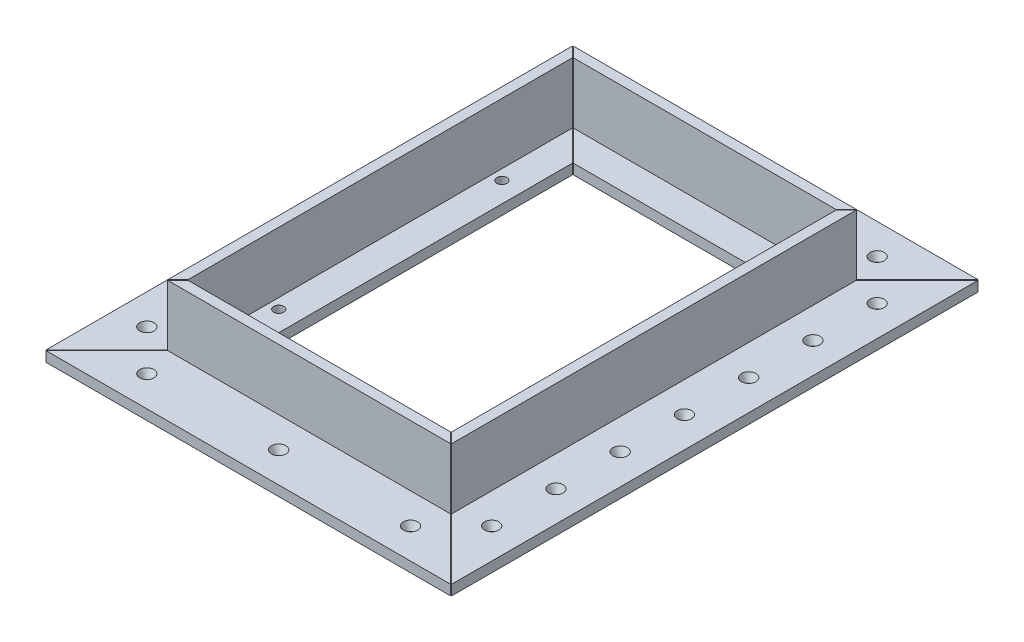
ISO-10303-21;
HEADER;
FILE_DESCRIPTION(('STEP AP214'),'2;1');
FILE_NAME('part.step','',(''),(''),'','','');
FILE_SCHEMA(('AUTOMOTIVE_DESIGN { 1 0 10303 214 1 1 1 1 }'));
ENDSEC;
DATA;
#1=APPLICATION_CONTEXT('core data for automotive mechanical design processes');
#2=APPLICATION_PROTOCOL_DEFINITION('international standard','automotive_design',2000,#1);
#3=PRODUCT_CONTEXT('',#1,'mechanical');
#4=PRODUCT('Part','Part','',(#3));
#5=PRODUCT_RELATED_PRODUCT_CATEGORY('part','',(#4));
#6=PRODUCT_DEFINITION_FORMATION('','',#4);
#7=PRODUCT_DEFINITION_CONTEXT('part definition',#1,'design');
#8=PRODUCT_DEFINITION('design','',#6,#7);
#9=PRODUCT_DEFINITION_SHAPE('','',#8);
#10=(LENGTH_UNIT() NAMED_UNIT(*) SI_UNIT(.MILLI.,.METRE.));
#11=(NAMED_UNIT(*) PLANE_ANGLE_UNIT() SI_UNIT($,.RADIAN.));
#12=(NAMED_UNIT(*) SI_UNIT($,.STERADIAN.) SOLID_ANGLE_UNIT());
#13=UNCERTAINTY_MEASURE_WITH_UNIT(LENGTH_MEASURE(1.E-05),#10,'distance_accuracy_value','');
#14=(GEOMETRIC_REPRESENTATION_CONTEXT(3) GLOBAL_UNCERTAINTY_ASSIGNED_CONTEXT((#13)) GLOBAL_UNIT_ASSIGNED_CONTEXT((#10,
#11,#12)) REPRESENTATION_CONTEXT('',''));
#15=CARTESIAN_POINT('',(0.,0.,0.));
#16=DIRECTION('',(0.,0.,1.));
#17=DIRECTION('',(1.,0.,0.));
#18=AXIS2_PLACEMENT_3D('',#15,#16,#17);
#19=CARTESIAN_POINT('',(-31.75,-19.05,63.5));
#20=DIRECTION('',(0.,-1.,0.));
#21=DIRECTION('',(1.,0.,0.));
#22=AXIS2_PLACEMENT_3D('',#19,#20,#21);
#23=PLANE('',#22);
#24=CARTESIAN_POINT('',(-38.1,-19.05,34.9249999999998));
#25=DIRECTION('',(0.,-1.,0.));
#26=DIRECTION('',(1.,0.,0.));
#27=AXIS2_PLACEMENT_3D('',#24,#25,#26);
#28=CIRCLE('',#27,1.5875);
#29=CARTESIAN_POINT('',(-36.5125,-19.05,34.9249999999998));
#30=VERTEX_POINT('',#29);
#31=EDGE_CURVE('E216',#30,#30,#28,.T.);
#32=ORIENTED_EDGE('',*,*,#31,.T.);
#33=EDGE_LOOP('',(#32));
#34=FACE_BOUND('',#33,.T.);
#35=CARTESIAN_POINT('',(-38.1,-19.05,-34.9250000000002));
#36=DIRECTION('',(0.,-1.,0.));
#37=DIRECTION('',(1.,0.,0.));
#38=AXIS2_PLACEMENT_3D('',#35,#36,#37);
#39=CIRCLE('',#38,1.5875);
#40=CARTESIAN_POINT('',(-36.5125,-19.05,-34.9250000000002));
#41=VERTEX_POINT('',#40);
#42=EDGE_CURVE('E139',#41,#41,#39,.T.);
#43=ORIENTED_EDGE('',*,*,#42,.T.);
#44=EDGE_LOOP('',(#43));
#45=FACE_BOUND('',#44,.T.);
#46=DIRECTION('',(0.,0.,-1.));
#47=VECTOR('',#46,1.);
#48=CARTESIAN_POINT('',(-31.75,-19.05,63.5));
#49=LINE('',#48,#47);
#50=CARTESIAN_POINT('',(-31.75,-19.05,50.6203948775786));
#51=VERTEX_POINT('',#50);
#52=CARTESIAN_POINT('',(-31.75,-19.05,-50.6203948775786));
#53=VERTEX_POINT('',#52);
#54=EDGE_CURVE('E135',#51,#53,#49,.T.);
#55=ORIENTED_EDGE('',*,*,#54,.T.);
#56=DIRECTION('',(-0.707106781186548,0.,-0.707106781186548));
#57=VECTOR('',#56,1.);
#58=CARTESIAN_POINT('',(25.3101974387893,-19.05,6.4398025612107));
#59=LINE('',#58,#57);
#60=CARTESIAN_POINT('',(-41.275,-19.05,-60.1453948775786));
#61=VERTEX_POINT('',#60);
#62=EDGE_CURVE('E138',#53,#61,#59,.T.);
#63=ORIENTED_EDGE('',*,*,#62,.T.);
#64=DIRECTION('',(0.,0.,-1.));
#65=VECTOR('',#64,1.);
#66=CARTESIAN_POINT('',(-41.275,-19.05,63.5));
#67=LINE('',#66,#65);
#68=CARTESIAN_POINT('',(-41.275,-19.05,60.1453948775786));
#69=VERTEX_POINT('',#68);
#70=EDGE_CURVE('E140',#69,#61,#67,.T.);
#71=ORIENTED_EDGE('',*,*,#70,.F.);
#72=DIRECTION('',(0.707106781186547,0.,-0.707106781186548));
#73=VECTOR('',#72,1.);
#74=CARTESIAN_POINT('',(-38.1898025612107,-19.05,57.0601974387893));
#75=LINE('',#74,#73);
#76=EDGE_CURVE('E153',#69,#51,#75,.T.);
#77=ORIENTED_EDGE('',*,*,#76,.T.);
#78=EDGE_LOOP('',(#55,#63,#71,#77));
#79=FACE_BOUND('',#78,.T.);
#80=ADVANCED_FACE('F43',(#34,#45,#79),#23,.F.);
#81=CARTESIAN_POINT('',(-44.45,0.,63.5));
#82=DIRECTION('',(1.,0.,0.));
#83=DIRECTION('',(0.,0.,-1.));
#84=AXIS2_PLACEMENT_3D('',#81,#82,#83);
#85=PLANE('',#84);
#86=DIRECTION('',(0.,0.,-1.));
#87=VECTOR('',#86,1.);
#88=CARTESIAN_POINT('',(-44.45,0.,63.5));
#89=LINE('',#88,#87);
#90=CARTESIAN_POINT('',(-44.45,0.,63.3203948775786));
#91=VERTEX_POINT('',#90);
#92=CARTESIAN_POINT('',(-44.45,0.,-63.3203948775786));
#93=VERTEX_POINT('',#92);
#94=EDGE_CURVE('E150',#91,#93,#89,.T.);
#95=ORIENTED_EDGE('',*,*,#94,.T.);
#96=DIRECTION('',(0.,-1.,0.));
#97=VECTOR('',#96,1.);
#98=CARTESIAN_POINT('',(-44.45,0.,-63.3203948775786));
#99=LINE('',#98,#97);
#100=CARTESIAN_POINT('',(-44.45,-19.05,-63.3203948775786));
#101=VERTEX_POINT('',#100);
#102=EDGE_CURVE('E59',#93,#101,#99,.T.);
#103=ORIENTED_EDGE('',*,*,#102,.T.);
#104=DIRECTION('',(0.,0.,-1.));
#105=VECTOR('',#104,1.);
#106=CARTESIAN_POINT('',(-44.45,-19.05,63.5));
#107=LINE('',#106,#105);
#108=CARTESIAN_POINT('',(-44.45,-19.05,63.3203948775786));
#109=VERTEX_POINT('',#108);
#110=EDGE_CURVE('E161',#109,#101,#107,.T.);
#111=ORIENTED_EDGE('',*,*,#110,.F.);
#112=DIRECTION('',(0.,1.,0.));
#113=VECTOR('',#112,1.);
#114=CARTESIAN_POINT('',(-44.45,0.,63.3203948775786));
#115=LINE('',#114,#113);
#116=EDGE_CURVE('E183',#109,#91,#115,.T.);
#117=ORIENTED_EDGE('',*,*,#116,.T.);
#118=EDGE_LOOP('',(#95,#103,#111,#117));
#119=FACE_BOUND('',#118,.T.);
#120=ADVANCED_FACE('F259',(#119),#85,.F.);
#121=CARTESIAN_POINT('',(-44.45,-19.05,63.5));
#122=DIRECTION('',(0.,-1.,0.));
#123=DIRECTION('',(1.,0.,0.));
#124=AXIS2_PLACEMENT_3D('',#121,#122,#123);
#125=PLANE('',#124);
#126=CARTESIAN_POINT('',(-53.975,-19.0500000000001,-60.325));
#127=DIRECTION('',(0.,-1.,0.));
#128=DIRECTION('',(1.,0.,0.));
#129=AXIS2_PLACEMENT_3D('',#126,#127,#128);
#130=CIRCLE('',#129,2.25047169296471);
#131=CARTESIAN_POINT('',(-51.7245283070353,-19.0500000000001,-60.325));
#132=VERTEX_POINT('',#131);
#133=EDGE_CURVE('E179',#132,#132,#130,.T.);
#134=ORIENTED_EDGE('',*,*,#133,.T.);
#135=EDGE_LOOP('',(#134));
#136=FACE_BOUND('',#135,.T.);
#137=CARTESIAN_POINT('',(-53.9750000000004,-19.0500000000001,-40.2166666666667));
#138=DIRECTION('',(0.,-1.,0.));
#139=DIRECTION('',(1.,0.,0.));
#140=AXIS2_PLACEMENT_3D('',#137,#138,#139);
#141=CIRCLE('',#140,2.25047169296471);
#142=CARTESIAN_POINT('',(-51.7245283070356,-19.0500000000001,-40.2166666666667));
#143=VERTEX_POINT('',#142);
#144=EDGE_CURVE('E182',#143,#143,#141,.T.);
#145=ORIENTED_EDGE('',*,*,#144,.T.);
#146=EDGE_LOOP('',(#145));
#147=FACE_BOUND('',#146,.T.);
#148=CARTESIAN_POINT('',(-53.975,-19.0500000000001,0.));
#149=DIRECTION('',(0.,-1.,0.));
#150=DIRECTION('',(1.,0.,0.));
#151=AXIS2_PLACEMENT_3D('',#148,#149,#150);
#152=CIRCLE('',#151,2.25047169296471);
#153=CARTESIAN_POINT('',(-51.7245283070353,-19.0500000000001,0.));
#154=VERTEX_POINT('',#153);
#155=EDGE_CURVE('E192',#154,#154,#152,.T.);
#156=ORIENTED_EDGE('',*,*,#155,.T.);
#157=EDGE_LOOP('',(#156));
#158=FACE_BOUND('',#157,.T.);
#159=CARTESIAN_POINT('',(-53.9750000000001,-19.0500000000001,40.2166666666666));
#160=DIRECTION('',(0.,-1.,0.));
#161=DIRECTION('',(1.,0.,0.));
#162=AXIS2_PLACEMENT_3D('',#159,#160,#161);
#163=CIRCLE('',#162,2.25047169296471);
#164=CARTESIAN_POINT('',(-51.7245283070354,-19.0500000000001,40.2166666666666));
#165=VERTEX_POINT('',#164);
#166=EDGE_CURVE('E201',#165,#165,#163,.T.);
#167=ORIENTED_EDGE('',*,*,#166,.T.);
#168=EDGE_LOOP('',(#167));
#169=FACE_BOUND('',#168,.T.);
#170=CARTESIAN_POINT('',(-53.9750000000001,-19.0500000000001,20.1083333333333));
#171=DIRECTION('',(0.,-1.,0.));
#172=DIRECTION('',(1.,0.,0.));
#173=AXIS2_PLACEMENT_3D('',#170,#171,#172);
#174=CIRCLE('',#173,2.25047169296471);
#175=CARTESIAN_POINT('',(-51.7245283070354,-19.0500000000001,20.1083333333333));
#176=VERTEX_POINT('',#175);
#177=EDGE_CURVE('E171',#176,#176,#174,.T.);
#178=ORIENTED_EDGE('',*,*,#177,.T.);
#179=EDGE_LOOP('',(#178));
#180=FACE_BOUND('',#179,.T.);
#181=CARTESIAN_POINT('',(-53.9750000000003,-19.0500000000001,-20.1083333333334));
#182=DIRECTION('',(0.,-1.,0.));
#183=DIRECTION('',(1.,0.,0.));
#184=AXIS2_PLACEMENT_3D('',#181,#182,#183);
#185=CIRCLE('',#184,2.25047169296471);
#186=CARTESIAN_POINT('',(-51.7245283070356,-19.0500000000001,-20.1083333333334));
#187=VERTEX_POINT('',#186);
#188=EDGE_CURVE('E162',#187,#187,#185,.T.);
#189=ORIENTED_EDGE('',*,*,#188,.T.);
#190=EDGE_LOOP('',(#189));
#191=FACE_BOUND('',#190,.T.);
#192=CARTESIAN_POINT('',(-53.975,-19.0500000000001,60.325));
#193=DIRECTION('',(0.,-1.,0.));
#194=DIRECTION('',(1.,0.,0.));
#195=AXIS2_PLACEMENT_3D('',#192,#193,#194);
#196=CIRCLE('',#195,2.25047169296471);
#197=CARTESIAN_POINT('',(-51.7245283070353,-19.0500000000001,60.325));
#198=VERTEX_POINT('',#197);
#199=EDGE_CURVE('E158',#198,#198,#196,.T.);
#200=ORIENTED_EDGE('',*,*,#199,.T.);
#201=EDGE_LOOP('',(#200));
#202=FACE_BOUND('',#201,.T.);
#203=ORIENTED_EDGE('',*,*,#110,.T.);
#204=DIRECTION('',(-0.707106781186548,0.,-0.707106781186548));
#205=VECTOR('',#204,1.);
#206=CARTESIAN_POINT('',(18.9601974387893,-19.05,0.0898025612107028));
#207=LINE('',#206,#205);
#208=CARTESIAN_POINT('',(-63.5,-19.0500000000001,-82.3703948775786));
#209=VERTEX_POINT('',#208);
#210=EDGE_CURVE('E224',#101,#209,#207,.T.);
#211=ORIENTED_EDGE('',*,*,#210,.T.);
#212=DIRECTION('',(0.,0.,-1.));
#213=VECTOR('',#212,1.);
#214=CARTESIAN_POINT('',(-63.5,-19.05,63.5));
#215=LINE('',#214,#213);
#216=CARTESIAN_POINT('',(-63.5,-19.0500000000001,82.3703948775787));
#217=VERTEX_POINT('',#216);
#218=EDGE_CURVE('E120',#217,#209,#215,.T.);
#219=ORIENTED_EDGE('',*,*,#218,.F.);
#220=DIRECTION('',(0.707106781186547,0.,-0.707106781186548));
#221=VECTOR('',#220,1.);
#222=CARTESIAN_POINT('',(-44.5398025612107,-19.05,63.4101974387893));
#223=LINE('',#222,#221);
#224=EDGE_CURVE('E225',#217,#109,#223,.T.);
#225=ORIENTED_EDGE('',*,*,#224,.T.);
#226=EDGE_LOOP('',(#203,#211,#219,#225));
#227=FACE_BOUND('',#226,.T.);
#228=ADVANCED_FACE('F256',(#136,#147,#158,#169,#180,#191,#202,#227),#125,.F.);
#229=CARTESIAN_POINT('',(-63.5,-19.05,63.5));
#230=DIRECTION('',(1.,0.,0.));
#231=DIRECTION('',(0.,0.,-1.));
#232=AXIS2_PLACEMENT_3D('',#229,#230,#231);
#233=PLANE('',#232);
#234=ORIENTED_EDGE('',*,*,#218,.T.);
#235=DIRECTION('',(0.,-1.,0.));
#236=VECTOR('',#235,1.);
#237=CARTESIAN_POINT('',(-63.5,-19.05,-82.3703948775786));
#238=LINE('',#237,#236);
#239=CARTESIAN_POINT('',(-63.5,-22.225,-82.3703948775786));
#240=VERTEX_POINT('',#239);
#241=EDGE_CURVE('E105',#209,#240,#238,.T.);
#242=ORIENTED_EDGE('',*,*,#241,.T.);
#243=DIRECTION('',(0.,0.,-1.));
#244=VECTOR('',#243,1.);
#245=CARTESIAN_POINT('',(-63.5,-22.225,63.5));
#246=LINE('',#245,#244);
#247=CARTESIAN_POINT('',(-63.5,-22.225,82.3703948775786));
#248=VERTEX_POINT('',#247);
#249=EDGE_CURVE('E112',#248,#240,#246,.T.);
#250=ORIENTED_EDGE('',*,*,#249,.F.);
#251=DIRECTION('',(0.,1.,0.));
#252=VECTOR('',#251,1.);
#253=CARTESIAN_POINT('',(-63.5,-19.05,82.3703948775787));
#254=LINE('',#253,#252);
#255=EDGE_CURVE('E121',#248,#217,#254,.T.);
#256=ORIENTED_EDGE('',*,*,#255,.T.);
#257=EDGE_LOOP('',(#234,#242,#250,#256));
#258=FACE_BOUND('',#257,.T.);
#259=ADVANCED_FACE('F117',(#258),#233,.F.);
#260=CARTESIAN_POINT('',(-63.5,-22.225,63.5));
#261=DIRECTION('',(0.,1.,0.));
#262=DIRECTION('',(0.,0.,1.));
#263=AXIS2_PLACEMENT_3D('',#260,#261,#262);
#264=PLANE('',#263);
#265=CARTESIAN_POINT('',(-38.1,-22.225,34.9249999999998));
#266=DIRECTION('',(0.,1.,0.));
#267=DIRECTION('',(-1.,0.,0.));
#268=AXIS2_PLACEMENT_3D('',#265,#266,#267);
#269=CIRCLE('',#268,1.5875);
#270=CARTESIAN_POINT('',(-39.6875,-22.225,34.9249999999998));
#271=VERTEX_POINT('',#270);
#272=EDGE_CURVE('E128',#271,#271,#269,.T.);
#273=ORIENTED_EDGE('',*,*,#272,.T.);
#274=EDGE_LOOP('',(#273));
#275=FACE_BOUND('',#274,.T.);
#276=CARTESIAN_POINT('',(-38.1,-22.225,-34.9250000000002));
#277=DIRECTION('',(0.,1.,0.));
#278=DIRECTION('',(-1.,0.,0.));
#279=AXIS2_PLACEMENT_3D('',#276,#277,#278);
#280=CIRCLE('',#279,1.5875);
#281=CARTESIAN_POINT('',(-39.6875,-22.225,-34.9250000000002));
#282=VERTEX_POINT('',#281);
#283=EDGE_CURVE('E125',#282,#282,#280,.T.);
#284=ORIENTED_EDGE('',*,*,#283,.T.);
#285=EDGE_LOOP('',(#284));
#286=FACE_BOUND('',#285,.T.);
#287=CARTESIAN_POINT('',(-53.975,-22.225,-60.325));
#288=DIRECTION('',(0.,1.,0.));
#289=DIRECTION('',(0.,0.,1.));
#290=AXIS2_PLACEMENT_3D('',#287,#288,#289);
#291=CIRCLE('',#290,1.04016546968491);
#292=CARTESIAN_POINT('',(-53.975,-22.225,-59.2848345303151));
#293=VERTEX_POINT('',#292);
#294=EDGE_CURVE('E175',#293,#293,#291,.F.);
#295=ORIENTED_EDGE('',*,*,#294,.F.);
#296=EDGE_LOOP('',(#295));
#297=FACE_BOUND('',#296,.T.);
#298=CARTESIAN_POINT('',(-53.9750000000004,-22.225,-40.2166666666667));
#299=DIRECTION('',(0.,1.,0.));
#300=DIRECTION('',(0.,0.,1.));
#301=AXIS2_PLACEMENT_3D('',#298,#299,#300);
#302=CIRCLE('',#301,1.04016546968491);
#303=CARTESIAN_POINT('',(-53.9750000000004,-22.225,-39.1765011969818));
#304=VERTEX_POINT('',#303);
#305=EDGE_CURVE('E186',#304,#304,#302,.F.);
#306=ORIENTED_EDGE('',*,*,#305,.F.);
#307=EDGE_LOOP('',(#306));
#308=FACE_BOUND('',#307,.T.);
#309=CARTESIAN_POINT('',(-53.975,-22.225,0.));
#310=DIRECTION('',(0.,1.,0.));
#311=DIRECTION('',(0.,0.,1.));
#312=AXIS2_PLACEMENT_3D('',#309,#310,#311);
#313=CIRCLE('',#312,1.04016546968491);
#314=CARTESIAN_POINT('',(-53.975,-22.225,1.04016546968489));
#315=VERTEX_POINT('',#314);
#316=EDGE_CURVE('E195',#315,#315,#313,.F.);
#317=ORIENTED_EDGE('',*,*,#316,.F.);
#318=EDGE_LOOP('',(#317));
#319=FACE_BOUND('',#318,.T.);
#320=CARTESIAN_POINT('',(-53.9750000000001,-22.225,40.2166666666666));
#321=DIRECTION('',(0.,1.,0.));
#322=DIRECTION('',(0.,0.,1.));
#323=AXIS2_PLACEMENT_3D('',#320,#321,#322);
#324=CIRCLE('',#323,1.04016546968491);
#325=CARTESIAN_POINT('',(-53.9750000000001,-22.225,41.2568321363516));
#326=VERTEX_POINT('',#325);
#327=EDGE_CURVE('E205',#326,#326,#324,.F.);
#328=ORIENTED_EDGE('',*,*,#327,.F.);
#329=EDGE_LOOP('',(#328));
#330=FACE_BOUND('',#329,.T.);
#331=CARTESIAN_POINT('',(-53.9750000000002,-22.225,20.1083333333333));
#332=DIRECTION('',(0.,1.,0.));
#333=DIRECTION('',(0.,0.,1.));
#334=AXIS2_PLACEMENT_3D('',#331,#332,#333);
#335=CIRCLE('',#334,1.04016546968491);
#336=CARTESIAN_POINT('',(-53.9750000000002,-22.225,21.1484988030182));
#337=VERTEX_POINT('',#336);
#338=EDGE_CURVE('E166',#337,#337,#335,.F.);
#339=ORIENTED_EDGE('',*,*,#338,.F.);
#340=EDGE_LOOP('',(#339));
#341=FACE_BOUND('',#340,.T.);
#342=CARTESIAN_POINT('',(-53.9750000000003,-22.225,-20.1083333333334));
#343=DIRECTION('',(0.,1.,0.));
#344=DIRECTION('',(0.,0.,1.));
#345=AXIS2_PLACEMENT_3D('',#342,#343,#344);
#346=CIRCLE('',#345,1.04016546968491);
#347=CARTESIAN_POINT('',(-53.9750000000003,-22.225,-19.0681678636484));
#348=VERTEX_POINT('',#347);
#349=EDGE_CURVE('E157',#348,#348,#346,.F.);
#350=ORIENTED_EDGE('',*,*,#349,.F.);
#351=EDGE_LOOP('',(#350));
#352=FACE_BOUND('',#351,.T.);
#353=CARTESIAN_POINT('',(-53.975,-22.225,60.325));
#354=DIRECTION('',(0.,1.,0.));
#355=DIRECTION('',(0.,0.,1.));
#356=AXIS2_PLACEMENT_3D('',#353,#354,#355);
#357=CIRCLE('',#356,1.04016546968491);
#358=CARTESIAN_POINT('',(-53.975,-22.225,61.3651654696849));
#359=VERTEX_POINT('',#358);
#360=EDGE_CURVE('E148',#359,#359,#357,.F.);
#361=ORIENTED_EDGE('',*,*,#360,.F.);
#362=EDGE_LOOP('',(#361));
#363=FACE_BOUND('',#362,.T.);
#364=ORIENTED_EDGE('',*,*,#249,.T.);
#365=DIRECTION('',(0.707106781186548,0.,0.707106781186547));
#366=VECTOR('',#365,1.);
#367=CARTESIAN_POINT('',(-31.8398025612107,-22.225,-50.7101974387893));
#368=LINE('',#367,#366);
#369=CARTESIAN_POINT('',(-31.75,-22.225,-50.6203948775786));
#370=VERTEX_POINT('',#369);
#371=EDGE_CURVE('E102',#240,#370,#368,.T.);
#372=ORIENTED_EDGE('',*,*,#371,.T.);
#373=DIRECTION('',(0.,0.,-1.));
#374=VECTOR('',#373,1.);
#375=CARTESIAN_POINT('',(-31.75,-22.225,63.5));
#376=LINE('',#375,#374);
#377=CARTESIAN_POINT('',(-31.75,-22.225,50.6203948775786));
#378=VERTEX_POINT('',#377);
#379=EDGE_CURVE('E133',#378,#370,#376,.T.);
#380=ORIENTED_EDGE('',*,*,#379,.F.);
#381=DIRECTION('',(-0.707106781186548,0.,0.707106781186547));
#382=VECTOR('',#381,1.);
#383=CARTESIAN_POINT('',(-44.5398025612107,-22.225,63.4101974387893));
#384=LINE('',#383,#382);
#385=EDGE_CURVE('E111',#378,#248,#384,.T.);
#386=ORIENTED_EDGE('',*,*,#385,.T.);
#387=EDGE_LOOP('',(#364,#372,#380,#386));
#388=FACE_BOUND('',#387,.T.);
#389=ADVANCED_FACE('F124',(#275,#286,#297,#308,#319,#330,#341,#352,#363,#388),#264,.F.);
#390=CARTESIAN_POINT('',(-31.75,-22.225,63.5));
#391=DIRECTION('',(-1.,0.,0.));
#392=DIRECTION('',(0.,0.,1.));
#393=AXIS2_PLACEMENT_3D('',#390,#391,#392);
#394=PLANE('',#393);
#395=ORIENTED_EDGE('',*,*,#379,.T.);
#396=DIRECTION('',(0.,1.,0.));
#397=VECTOR('',#396,1.);
#398=CARTESIAN_POINT('',(-31.75,-22.225,-50.6203948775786));
#399=LINE('',#398,#397);
#400=EDGE_CURVE('E100',#370,#53,#399,.T.);
#401=ORIENTED_EDGE('',*,*,#400,.T.);
#402=ORIENTED_EDGE('',*,*,#54,.F.);
#403=DIRECTION('',(0.,-1.,0.));
#404=VECTOR('',#403,1.);
#405=CARTESIAN_POINT('',(-31.75,-22.225,50.6203948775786));
#406=LINE('',#405,#404);
#407=EDGE_CURVE('E144',#51,#378,#406,.T.);
#408=ORIENTED_EDGE('',*,*,#407,.T.);
#409=EDGE_LOOP('',(#395,#401,#402,#408));
#410=FACE_BOUND('',#409,.T.);
#411=ADVANCED_FACE('F252',(#410),#394,.F.);
#412=CARTESIAN_POINT('',(-41.275,0.,63.5));
#413=DIRECTION('',(-1.,0.,0.));
#414=DIRECTION('',(0.,0.,1.));
#415=AXIS2_PLACEMENT_3D('',#412,#413,#414);
#416=PLANE('',#415);
#417=ORIENTED_EDGE('',*,*,#70,.T.);
#418=DIRECTION('',(0.,1.,0.));
#419=VECTOR('',#418,1.);
#420=CARTESIAN_POINT('',(-41.275,0.,-60.1453948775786));
#421=LINE('',#420,#419);
#422=CARTESIAN_POINT('',(-41.275,0.,-60.1453948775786));
#423=VERTEX_POINT('',#422);
#424=EDGE_CURVE('E143',#61,#423,#421,.T.);
#425=ORIENTED_EDGE('',*,*,#424,.T.);
#426=DIRECTION('',(0.,0.,-1.));
#427=VECTOR('',#426,1.);
#428=CARTESIAN_POINT('',(-41.275,0.,63.5));
#429=LINE('',#428,#427);
#430=CARTESIAN_POINT('',(-41.275,0.,60.1453948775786));
#431=VERTEX_POINT('',#430);
#432=EDGE_CURVE('E145',#431,#423,#429,.T.);
#433=ORIENTED_EDGE('',*,*,#432,.F.);
#434=DIRECTION('',(0.,-1.,0.));
#435=VECTOR('',#434,1.);
#436=CARTESIAN_POINT('',(-41.275,0.,60.1453948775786));
#437=LINE('',#436,#435);
#438=EDGE_CURVE('E149',#431,#69,#437,.T.);
#439=ORIENTED_EDGE('',*,*,#438,.T.);
#440=EDGE_LOOP('',(#417,#425,#433,#439));
#441=FACE_BOUND('',#440,.T.);
#442=ADVANCED_FACE('F246',(#441),#416,.F.);
#443=CARTESIAN_POINT('',(-44.45,0.,63.5));
#444=DIRECTION('',(0.,-1.,0.));
#445=DIRECTION('',(0.,0.,-1.));
#446=AXIS2_PLACEMENT_3D('',#443,#444,#445);
#447=PLANE('',#446);
#448=ORIENTED_EDGE('',*,*,#432,.T.);
#449=DIRECTION('',(0.707106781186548,0.,0.707106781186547));
#450=VECTOR('',#449,1.);
#451=CARTESIAN_POINT('',(-31.8398025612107,0.,-50.7101974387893));
#452=LINE('',#451,#450);
#453=EDGE_CURVE('E12',#93,#423,#452,.T.);
#454=ORIENTED_EDGE('',*,*,#453,.F.);
#455=ORIENTED_EDGE('',*,*,#94,.F.);
#456=DIRECTION('',(-0.707106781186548,0.,0.707106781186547));
#457=VECTOR('',#456,1.);
#458=CARTESIAN_POINT('',(-44.5398025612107,0.,63.4101974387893));
#459=LINE('',#458,#457);
#460=EDGE_CURVE('E46',#431,#91,#459,.T.);
#461=ORIENTED_EDGE('',*,*,#460,.F.);
#462=EDGE_LOOP('',(#448,#454,#455,#461));
#463=FACE_BOUND('',#462,.T.);
#464=ADVANCED_FACE('F262',(#463),#447,.F.);
#465=CARTESIAN_POINT('',(-53.975,-21.3000448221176,60.325));
#466=DIRECTION('',(0.,1.,0.));
#467=DIRECTION('',(-1.,0.,0.));
#468=AXIS2_PLACEMENT_3D('',#465,#466,#467);
#469=CONICAL_SURFACE('',#468,1.04087553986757,0.000767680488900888);
#470=CARTESIAN_POINT('',(-53.975,-21.3000448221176,60.325));
#471=DIRECTION('',(0.,-1.,0.));
#472=DIRECTION('',(1.,0.,0.));
#473=AXIS2_PLACEMENT_3D('',#470,#471,#472);
#474=CIRCLE('',#473,1.04087553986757);
#475=CARTESIAN_POINT('',(-52.9341244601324,-21.3000448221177,60.325));
#476=VERTEX_POINT('',#475);
#477=EDGE_CURVE('E154',#476,#476,#474,.T.);
#478=ORIENTED_EDGE('',*,*,#477,.F.);
#479=EDGE_LOOP('',(#478));
#480=FACE_BOUND('',#479,.T.);
#481=ORIENTED_EDGE('',*,*,#360,.T.);
#482=EDGE_LOOP('',(#481));
#483=FACE_BOUND('',#482,.T.);
#484=ADVANCED_FACE('F264',(#480,#483),#469,.F.);
#485=CARTESIAN_POINT('',(-53.975,-21.3000448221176,60.325));
#486=DIRECTION('',(0.,1.,0.));
#487=DIRECTION('',(-1.,0.,0.));
#488=AXIS2_PLACEMENT_3D('',#485,#486,#487);
#489=CONICAL_SURFACE('',#488,1.04087553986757,0.493263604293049);
#490=ORIENTED_EDGE('',*,*,#199,.F.);
#491=EDGE_LOOP('',(#490));
#492=FACE_BOUND('',#491,.T.);
#493=ORIENTED_EDGE('',*,*,#477,.T.);
#494=EDGE_LOOP('',(#493));
#495=FACE_BOUND('',#494,.T.);
#496=ADVANCED_FACE('F270',(#492,#495),#489,.F.);
#497=CARTESIAN_POINT('',(-53.9750000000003,-21.3000448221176,-20.1083333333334));
#498=DIRECTION('',(0.,1.,0.));
#499=DIRECTION('',(-1.,0.,0.));
#500=AXIS2_PLACEMENT_3D('',#497,#498,#499);
#501=CONICAL_SURFACE('',#500,1.04087553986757,0.000767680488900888);
#502=CARTESIAN_POINT('',(-53.9750000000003,-21.3000448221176,-20.1083333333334));
#503=DIRECTION('',(0.,-1.,0.));
#504=DIRECTION('',(1.,0.,0.));
#505=AXIS2_PLACEMENT_3D('',#502,#503,#504);
#506=CIRCLE('',#505,1.04087553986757);
#507=CARTESIAN_POINT('',(-52.9341244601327,-21.3000448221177,-20.1083333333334));
#508=VERTEX_POINT('',#507);
#509=EDGE_CURVE('E163',#508,#508,#506,.T.);
#510=ORIENTED_EDGE('',*,*,#509,.F.);
#511=EDGE_LOOP('',(#510));
#512=FACE_BOUND('',#511,.T.);
#513=ORIENTED_EDGE('',*,*,#349,.T.);
#514=EDGE_LOOP('',(#513));
#515=FACE_BOUND('',#514,.T.);
#516=ADVANCED_FACE('F337',(#512,#515),#501,.F.);
#517=CARTESIAN_POINT('',(-53.9750000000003,-21.3000448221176,-20.1083333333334));
#518=DIRECTION('',(0.,1.,0.));
#519=DIRECTION('',(-1.,0.,0.));
#520=AXIS2_PLACEMENT_3D('',#517,#518,#519);
#521=CONICAL_SURFACE('',#520,1.04087553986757,0.493263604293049);
#522=ORIENTED_EDGE('',*,*,#188,.F.);
#523=EDGE_LOOP('',(#522));
#524=FACE_BOUND('',#523,.T.);
#525=ORIENTED_EDGE('',*,*,#509,.T.);
#526=EDGE_LOOP('',(#525));
#527=FACE_BOUND('',#526,.T.);
#528=ADVANCED_FACE('F339',(#524,#527),#521,.F.);
#529=CARTESIAN_POINT('',(-53.9750000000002,-21.3000448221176,20.1083333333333));
#530=DIRECTION('',(0.,1.,0.));
#531=DIRECTION('',(-1.,0.,0.));
#532=AXIS2_PLACEMENT_3D('',#529,#530,#531);
#533=CONICAL_SURFACE('',#532,1.04087553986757,0.000767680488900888);
#534=CARTESIAN_POINT('',(-53.9750000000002,-21.3000448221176,20.1083333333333));
#535=DIRECTION('',(0.,-1.,0.));
#536=DIRECTION('',(1.,0.,0.));
#537=AXIS2_PLACEMENT_3D('',#534,#535,#536);
#538=CIRCLE('',#537,1.04087553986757);
#539=CARTESIAN_POINT('',(-52.9341244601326,-21.3000448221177,20.1083333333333));
#540=VERTEX_POINT('',#539);
#541=EDGE_CURVE('E202',#540,#540,#538,.T.);
#542=ORIENTED_EDGE('',*,*,#541,.F.);
#543=EDGE_LOOP('',(#542));
#544=FACE_BOUND('',#543,.T.);
#545=ORIENTED_EDGE('',*,*,#338,.T.);
#546=EDGE_LOOP('',(#545));
#547=FACE_BOUND('',#546,.T.);
#548=ADVANCED_FACE('F346',(#544,#547),#533,.F.);
#549=CARTESIAN_POINT('',(-53.9750000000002,-21.3000448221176,20.1083333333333));
#550=DIRECTION('',(0.,1.,0.));
#551=DIRECTION('',(-1.,0.,0.));
#552=AXIS2_PLACEMENT_3D('',#549,#550,#551);
#553=CONICAL_SURFACE('',#552,1.04087553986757,0.493263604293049);
#554=ORIENTED_EDGE('',*,*,#177,.F.);
#555=EDGE_LOOP('',(#554));
#556=FACE_BOUND('',#555,.T.);
#557=ORIENTED_EDGE('',*,*,#541,.T.);
#558=EDGE_LOOP('',(#557));
#559=FACE_BOUND('',#558,.T.);
#560=ADVANCED_FACE('F374',(#556,#559),#553,.F.);
#561=CARTESIAN_POINT('',(-53.9750000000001,-21.3000448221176,40.2166666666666));
#562=DIRECTION('',(0.,1.,0.));
#563=DIRECTION('',(-1.,0.,0.));
#564=AXIS2_PLACEMENT_3D('',#561,#562,#563);
#565=CONICAL_SURFACE('',#564,1.04087553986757,0.000767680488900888);
#566=CARTESIAN_POINT('',(-53.9750000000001,-21.3000448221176,40.2166666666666));
#567=DIRECTION('',(0.,-1.,0.));
#568=DIRECTION('',(1.,0.,0.));
#569=AXIS2_PLACEMENT_3D('',#566,#567,#568);
#570=CIRCLE('',#569,1.04087553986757);
#571=CARTESIAN_POINT('',(-52.9341244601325,-21.3000448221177,40.2166666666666));
#572=VERTEX_POINT('',#571);
#573=EDGE_CURVE('E198',#572,#572,#570,.T.);
#574=ORIENTED_EDGE('',*,*,#573,.F.);
#575=EDGE_LOOP('',(#574));
#576=FACE_BOUND('',#575,.T.);
#577=ORIENTED_EDGE('',*,*,#327,.T.);
#578=EDGE_LOOP('',(#577));
#579=FACE_BOUND('',#578,.T.);
#580=ADVANCED_FACE('F377',(#576,#579),#565,.F.);
#581=CARTESIAN_POINT('',(-53.9750000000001,-21.3000448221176,40.2166666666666));
#582=DIRECTION('',(0.,1.,0.));
#583=DIRECTION('',(-1.,0.,0.));
#584=AXIS2_PLACEMENT_3D('',#581,#582,#583);
#585=CONICAL_SURFACE('',#584,1.04087553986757,0.493263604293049);
#586=ORIENTED_EDGE('',*,*,#166,.F.);
#587=EDGE_LOOP('',(#586));
#588=FACE_BOUND('',#587,.T.);
#589=ORIENTED_EDGE('',*,*,#573,.T.);
#590=EDGE_LOOP('',(#589));
#591=FACE_BOUND('',#590,.T.);
#592=ADVANCED_FACE('F303',(#588,#591),#585,.F.);
#593=CARTESIAN_POINT('',(-53.975,-21.3000448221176,0.));
#594=DIRECTION('',(0.,1.,0.));
#595=DIRECTION('',(-1.,0.,0.));
#596=AXIS2_PLACEMENT_3D('',#593,#594,#595);
#597=CONICAL_SURFACE('',#596,1.04087553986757,0.000767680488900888);
#598=CARTESIAN_POINT('',(-53.975,-21.3000448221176,0.));
#599=DIRECTION('',(0.,-1.,0.));
#600=DIRECTION('',(1.,0.,0.));
#601=AXIS2_PLACEMENT_3D('',#598,#599,#600);
#602=CIRCLE('',#601,1.04087553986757);
#603=CARTESIAN_POINT('',(-52.9341244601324,-21.3000448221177,0.));
#604=VERTEX_POINT('',#603);
#605=EDGE_CURVE('E189',#604,#604,#602,.T.);
#606=ORIENTED_EDGE('',*,*,#605,.F.);
#607=EDGE_LOOP('',(#606));
#608=FACE_BOUND('',#607,.T.);
#609=ORIENTED_EDGE('',*,*,#316,.T.);
#610=EDGE_LOOP('',(#609));
#611=FACE_BOUND('',#610,.T.);
#612=ADVANCED_FACE('F365',(#608,#611),#597,.F.);
#613=CARTESIAN_POINT('',(-53.975,-21.3000448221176,0.));
#614=DIRECTION('',(0.,1.,0.));
#615=DIRECTION('',(-1.,0.,0.));
#616=AXIS2_PLACEMENT_3D('',#613,#614,#615);
#617=CONICAL_SURFACE('',#616,1.04087553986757,0.493263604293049);
#618=ORIENTED_EDGE('',*,*,#155,.F.);
#619=EDGE_LOOP('',(#618));
#620=FACE_BOUND('',#619,.T.);
#621=ORIENTED_EDGE('',*,*,#605,.T.);
#622=EDGE_LOOP('',(#621));
#623=FACE_BOUND('',#622,.T.);
#624=ADVANCED_FACE('F360',(#620,#623),#617,.F.);
#625=CARTESIAN_POINT('',(-53.9750000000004,-21.3000448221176,-40.2166666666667));
#626=DIRECTION('',(0.,1.,0.));
#627=DIRECTION('',(-1.,0.,0.));
#628=AXIS2_PLACEMENT_3D('',#625,#626,#627);
#629=CONICAL_SURFACE('',#628,1.04087553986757,0.000767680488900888);
#630=CARTESIAN_POINT('',(-53.9750000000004,-21.3000448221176,-40.2166666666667));
#631=DIRECTION('',(0.,-1.,0.));
#632=DIRECTION('',(1.,0.,0.));
#633=AXIS2_PLACEMENT_3D('',#630,#631,#632);
#634=CIRCLE('',#633,1.04087553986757);
#635=CARTESIAN_POINT('',(-52.9341244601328,-21.3000448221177,-40.2166666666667));
#636=VERTEX_POINT('',#635);
#637=EDGE_CURVE('E178',#636,#636,#634,.T.);
#638=ORIENTED_EDGE('',*,*,#637,.F.);
#639=EDGE_LOOP('',(#638));
#640=FACE_BOUND('',#639,.T.);
#641=ORIENTED_EDGE('',*,*,#305,.T.);
#642=EDGE_LOOP('',(#641));
#643=FACE_BOUND('',#642,.T.);
#644=ADVANCED_FACE('F357',(#640,#643),#629,.F.);
#645=CARTESIAN_POINT('',(-53.9750000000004,-21.3000448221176,-40.2166666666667));
#646=DIRECTION('',(0.,1.,0.));
#647=DIRECTION('',(-1.,0.,0.));
#648=AXIS2_PLACEMENT_3D('',#645,#646,#647);
#649=CONICAL_SURFACE('',#648,1.04087553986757,0.493263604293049);
#650=ORIENTED_EDGE('',*,*,#144,.F.);
#651=EDGE_LOOP('',(#650));
#652=FACE_BOUND('',#651,.T.);
#653=ORIENTED_EDGE('',*,*,#637,.T.);
#654=EDGE_LOOP('',(#653));
#655=FACE_BOUND('',#654,.T.);
#656=ADVANCED_FACE('F354',(#652,#655),#649,.F.);
#657=CARTESIAN_POINT('',(-53.975,-21.3000448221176,-60.325));
#658=DIRECTION('',(0.,1.,0.));
#659=DIRECTION('',(-1.,0.,0.));
#660=AXIS2_PLACEMENT_3D('',#657,#658,#659);
#661=CONICAL_SURFACE('',#660,1.04087553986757,0.000767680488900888);
#662=CARTESIAN_POINT('',(-53.975,-21.3000448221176,-60.325));
#663=DIRECTION('',(0.,-1.,0.));
#664=DIRECTION('',(1.,0.,0.));
#665=AXIS2_PLACEMENT_3D('',#662,#663,#664);
#666=CIRCLE('',#665,1.04087553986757);
#667=CARTESIAN_POINT('',(-52.9341244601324,-21.3000448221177,-60.325));
#668=VERTEX_POINT('',#667);
#669=EDGE_CURVE('E172',#668,#668,#666,.T.);
#670=ORIENTED_EDGE('',*,*,#669,.F.);
#671=EDGE_LOOP('',(#670));
#672=FACE_BOUND('',#671,.T.);
#673=ORIENTED_EDGE('',*,*,#294,.T.);
#674=EDGE_LOOP('',(#673));
#675=FACE_BOUND('',#674,.T.);
#676=ADVANCED_FACE('F298',(#672,#675),#661,.F.);
#677=CARTESIAN_POINT('',(-53.975,-21.3000448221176,-60.325));
#678=DIRECTION('',(0.,1.,0.));
#679=DIRECTION('',(-1.,0.,0.));
#680=AXIS2_PLACEMENT_3D('',#677,#678,#679);
#681=CONICAL_SURFACE('',#680,1.04087553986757,0.493263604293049);
#682=ORIENTED_EDGE('',*,*,#133,.F.);
#683=EDGE_LOOP('',(#682));
#684=FACE_BOUND('',#683,.T.);
#685=ORIENTED_EDGE('',*,*,#669,.T.);
#686=EDGE_LOOP('',(#685));
#687=FACE_BOUND('',#686,.T.);
#688=ADVANCED_FACE('F288',(#684,#687),#681,.F.);
#689=CARTESIAN_POINT('',(-38.1,-22.225,-34.9250000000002));
#690=DIRECTION('',(0.,1.,0.));
#691=DIRECTION('',(-1.,0.,0.));
#692=AXIS2_PLACEMENT_3D('',#689,#690,#691);
#693=CYLINDRICAL_SURFACE('',#692,1.5875);
#694=ORIENTED_EDGE('',*,*,#283,.F.);
#695=EDGE_LOOP('',(#694));
#696=FACE_BOUND('',#695,.T.);
#697=ORIENTED_EDGE('',*,*,#42,.F.);
#698=EDGE_LOOP('',(#697));
#699=FACE_BOUND('',#698,.T.);
#700=ADVANCED_FACE('F285',(#696,#699),#693,.F.);
#701=CARTESIAN_POINT('',(-38.1,-22.225,34.9249999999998));
#702=DIRECTION('',(0.,1.,0.));
#703=DIRECTION('',(-1.,0.,0.));
#704=AXIS2_PLACEMENT_3D('',#701,#702,#703);
#705=CYLINDRICAL_SURFACE('',#704,1.5875);
#706=ORIENTED_EDGE('',*,*,#272,.F.);
#707=EDGE_LOOP('',(#706));
#708=FACE_BOUND('',#707,.T.);
#709=ORIENTED_EDGE('',*,*,#31,.F.);
#710=EDGE_LOOP('',(#709));
#711=FACE_BOUND('',#710,.T.);
#712=ADVANCED_FACE('F287',(#708,#711),#705,.F.);
#713=CARTESIAN_POINT('',(-41.3648025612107,-22.225,60.2351974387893));
#714=DIRECTION('',(-0.707106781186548,0.,-0.707106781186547));
#715=DIRECTION('',(-0.707106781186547,0.,0.707106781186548));
#716=AXIS2_PLACEMENT_3D('',#713,#714,#715);
#717=PLANE('',#716);
#718=ORIENTED_EDGE('',*,*,#224,.F.);
#719=ORIENTED_EDGE('',*,*,#255,.F.);
#720=ORIENTED_EDGE('',*,*,#385,.F.);
#721=ORIENTED_EDGE('',*,*,#407,.F.);
#722=ORIENTED_EDGE('',*,*,#76,.F.);
#723=ORIENTED_EDGE('',*,*,#438,.F.);
#724=ORIENTED_EDGE('',*,*,#460,.T.);
#725=ORIENTED_EDGE('',*,*,#116,.F.);
#726=EDGE_LOOP('',(#718,#719,#720,#721,#722,#723,#724,#725));
#727=FACE_BOUND('',#726,.T.);
#728=ADVANCED_FACE('F253',(#727),#717,.F.);
#729=CARTESIAN_POINT('',(-41.3648025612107,-22.225,-60.2351974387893));
#730=DIRECTION('',(-0.707106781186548,0.,0.707106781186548));
#731=DIRECTION('',(0.707106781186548,0.,0.707106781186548));
#732=AXIS2_PLACEMENT_3D('',#729,#730,#731);
#733=PLANE('',#732);
#734=ORIENTED_EDGE('',*,*,#453,.T.);
#735=ORIENTED_EDGE('',*,*,#424,.F.);
#736=ORIENTED_EDGE('',*,*,#62,.F.);
#737=ORIENTED_EDGE('',*,*,#400,.F.);
#738=ORIENTED_EDGE('',*,*,#371,.F.);
#739=ORIENTED_EDGE('',*,*,#241,.F.);
#740=ORIENTED_EDGE('',*,*,#210,.F.);
#741=ORIENTED_EDGE('',*,*,#102,.F.);
#742=EDGE_LOOP('',(#734,#735,#736,#737,#738,#739,#740,#741));
#743=FACE_BOUND('',#742,.T.);
#744=ADVANCED_FACE('F104',(#743),#733,.F.);
#745=CLOSED_SHELL('',(#80,#120,#228,#259,#389,#411,#442,#464,#484,#496,#516,#528,#548,#560,#580,
#592,#612,#624,#644,#656,#676,#688,#700,#712,#728,#744));
#746=MANIFOLD_SOLID_BREP('B2',#745);
#747=CARTESIAN_POINT('',(41.275,-21.3000448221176,-73.025));
#748=DIRECTION('',(0.,1.,0.));
#749=DIRECTION('',(-1.,0.,0.));
#750=AXIS2_PLACEMENT_3D('',#747,#748,#749);
#751=CONICAL_SURFACE('',#750,1.04087553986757,0.493263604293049);
#752=CARTESIAN_POINT('',(41.275,-19.0500000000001,-73.025));
#753=DIRECTION('',(0.,-1.,0.));
#754=DIRECTION('',(1.,0.,0.));
#755=AXIS2_PLACEMENT_3D('',#752,#753,#754);
#756=CIRCLE('',#755,2.25047169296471);
#757=CARTESIAN_POINT('',(43.5254716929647,-19.0500000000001,-73.025));
#758=VERTEX_POINT('',#757);
#759=EDGE_CURVE('E775',#758,#758,#756,.T.);
#760=ORIENTED_EDGE('',*,*,#759,.F.);
#761=EDGE_LOOP('',(#760));
#762=FACE_BOUND('',#761,.T.);
#763=CARTESIAN_POINT('',(41.275,-21.3000448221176,-73.025));
#764=DIRECTION('',(0.,-1.,0.));
#765=DIRECTION('',(1.,0.,0.));
#766=AXIS2_PLACEMENT_3D('',#763,#764,#765);
#767=CIRCLE('',#766,1.04087553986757);
#768=CARTESIAN_POINT('',(42.3158755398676,-21.3000448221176,-73.025));
#769=VERTEX_POINT('',#768);
#770=EDGE_CURVE('E766',#769,#769,#767,.T.);
#771=ORIENTED_EDGE('',*,*,#770,.T.);
#772=EDGE_LOOP('',(#771));
#773=FACE_BOUND('',#772,.T.);
#774=ADVANCED_FACE('F658',(#762,#773),#751,.F.);
#775=CARTESIAN_POINT('',(0.,-21.3000448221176,-73.025));
#776=DIRECTION('',(0.,1.,0.));
#777=DIRECTION('',(-1.,0.,0.));
#778=AXIS2_PLACEMENT_3D('',#775,#776,#777);
#779=CONICAL_SURFACE('',#778,1.04087553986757,0.493263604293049);
#780=CARTESIAN_POINT('',(0.,-19.0500000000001,-73.025));
#781=DIRECTION('',(0.,-1.,0.));
#782=DIRECTION('',(1.,0.,0.));
#783=AXIS2_PLACEMENT_3D('',#780,#781,#782);
#784=CIRCLE('',#783,2.25047169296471);
#785=CARTESIAN_POINT('',(2.25047169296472,-19.0500000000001,-73.025));
#786=VERTEX_POINT('',#785);
#787=EDGE_CURVE('E742',#786,#786,#784,.T.);
#788=ORIENTED_EDGE('',*,*,#787,.F.);
#789=EDGE_LOOP('',(#788));
#790=FACE_BOUND('',#789,.T.);
#791=CARTESIAN_POINT('',(0.,-21.3000448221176,-73.025));
#792=DIRECTION('',(0.,-1.,0.));
#793=DIRECTION('',(1.,0.,0.));
#794=AXIS2_PLACEMENT_3D('',#791,#792,#793);
#795=CIRCLE('',#794,1.04087553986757);
#796=CARTESIAN_POINT('',(1.04087553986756,-21.3000448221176,-73.025));
#797=VERTEX_POINT('',#796);
#798=EDGE_CURVE('E769',#797,#797,#795,.T.);
#799=ORIENTED_EDGE('',*,*,#798,.T.);
#800=EDGE_LOOP('',(#799));
#801=FACE_BOUND('',#800,.T.);
#802=ADVANCED_FACE('F842',(#790,#801),#779,.F.);
#803=CARTESIAN_POINT('',(-41.275,-21.3000448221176,-73.025));
#804=DIRECTION('',(0.,1.,0.));
#805=DIRECTION('',(-1.,0.,0.));
#806=AXIS2_PLACEMENT_3D('',#803,#804,#805);
#807=CONICAL_SURFACE('',#806,1.04087553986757,0.493263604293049);
#808=CARTESIAN_POINT('',(-41.275,-19.0500000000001,-73.025));
#809=DIRECTION('',(0.,-1.,0.));
#810=DIRECTION('',(1.,0.,0.));
#811=AXIS2_PLACEMENT_3D('',#808,#809,#810);
#812=CIRCLE('',#811,2.25047169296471);
#813=CARTESIAN_POINT('',(-39.0245283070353,-19.0500000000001,-73.025));
#814=VERTEX_POINT('',#813);
#815=EDGE_CURVE('E739',#814,#814,#812,.T.);
#816=ORIENTED_EDGE('',*,*,#815,.F.);
#817=EDGE_LOOP('',(#816));
#818=FACE_BOUND('',#817,.T.);
#819=CARTESIAN_POINT('',(-41.275,-21.3000448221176,-73.025));
#820=DIRECTION('',(0.,-1.,0.));
#821=DIRECTION('',(1.,0.,0.));
#822=AXIS2_PLACEMENT_3D('',#819,#820,#821);
#823=CIRCLE('',#822,1.04087553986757);
#824=CARTESIAN_POINT('',(-40.2341244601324,-21.3000448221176,-73.025));
#825=VERTEX_POINT('',#824);
#826=EDGE_CURVE('E774',#825,#825,#823,.T.);
#827=ORIENTED_EDGE('',*,*,#826,.T.);
#828=EDGE_LOOP('',(#827));
#829=FACE_BOUND('',#828,.T.);
#830=ADVANCED_FACE('F848',(#818,#829),#807,.F.);
#831=CARTESIAN_POINT('',(41.275,-21.3000448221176,-73.025));
#832=DIRECTION('',(0.,1.,0.));
#833=DIRECTION('',(-1.,0.,0.));
#834=AXIS2_PLACEMENT_3D('',#831,#832,#833);
#835=CONICAL_SURFACE('',#834,1.04087553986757,0.000767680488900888);
#836=ORIENTED_EDGE('',*,*,#770,.F.);
#837=EDGE_LOOP('',(#836));
#838=FACE_BOUND('',#837,.T.);
#839=CARTESIAN_POINT('',(41.275,-22.225,-73.0250000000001));
#840=DIRECTION('',(0.,1.,0.));
#841=DIRECTION('',(0.,0.,1.));
#842=AXIS2_PLACEMENT_3D('',#839,#840,#841);
#843=CIRCLE('',#842,1.04016546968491);
#844=CARTESIAN_POINT('',(41.275,-22.225,-71.9848345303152));
#845=VERTEX_POINT('',#844);
#846=EDGE_CURVE('E770',#845,#845,#843,.F.);
#847=ORIENTED_EDGE('',*,*,#846,.T.);
#848=EDGE_LOOP('',(#847));
#849=FACE_BOUND('',#848,.T.);
#850=ADVANCED_FACE('F855',(#838,#849),#835,.F.);
#851=CARTESIAN_POINT('',(0.,-21.3000448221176,-73.025));
#852=DIRECTION('',(0.,1.,0.));
#853=DIRECTION('',(-1.,0.,0.));
#854=AXIS2_PLACEMENT_3D('',#851,#852,#853);
#855=CONICAL_SURFACE('',#854,1.04087553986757,0.000767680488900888);
#856=ORIENTED_EDGE('',*,*,#798,.F.);
#857=EDGE_LOOP('',(#856));
#858=FACE_BOUND('',#857,.T.);
#859=CARTESIAN_POINT('',(0.,-22.225,-73.025));
#860=DIRECTION('',(0.,1.,0.));
#861=DIRECTION('',(0.,0.,1.));
#862=AXIS2_PLACEMENT_3D('',#859,#860,#861);
#863=CIRCLE('',#862,1.04016546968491);
#864=CARTESIAN_POINT('',(0.,-22.225,-71.9848345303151));
#865=VERTEX_POINT('',#864);
#866=EDGE_CURVE('E773',#865,#865,#863,.F.);
#867=ORIENTED_EDGE('',*,*,#866,.T.);
#868=EDGE_LOOP('',(#867));
#869=FACE_BOUND('',#868,.T.);
#870=ADVANCED_FACE('F857',(#858,#869),#855,.F.);
#871=CARTESIAN_POINT('',(-41.275,-21.3000448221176,-73.025));
#872=DIRECTION('',(0.,1.,0.));
#873=DIRECTION('',(-1.,0.,0.));
#874=AXIS2_PLACEMENT_3D('',#871,#872,#873);
#875=CONICAL_SURFACE('',#874,1.04087553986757,0.000767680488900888);
#876=ORIENTED_EDGE('',*,*,#826,.F.);
#877=EDGE_LOOP('',(#876));
#878=FACE_BOUND('',#877,.T.);
#879=CARTESIAN_POINT('',(-41.275,-22.225,-73.025));
#880=DIRECTION('',(0.,1.,0.));
#881=DIRECTION('',(0.,0.,1.));
#882=AXIS2_PLACEMENT_3D('',#879,#880,#881);
#883=CIRCLE('',#882,1.04016546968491);
#884=CARTESIAN_POINT('',(-41.275,-22.225,-71.9848345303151));
#885=VERTEX_POINT('',#884);
#886=EDGE_CURVE('E782',#885,#885,#883,.F.);
#887=ORIENTED_EDGE('',*,*,#886,.T.);
#888=EDGE_LOOP('',(#887));
#889=FACE_BOUND('',#888,.T.);
#890=ADVANCED_FACE('F859',(#878,#889),#875,.F.);
#891=CARTESIAN_POINT('',(-44.45,-19.05,-50.8));
#892=DIRECTION('',(0.,0.,1.));
#893=DIRECTION('',(1.,0.,0.));
#894=AXIS2_PLACEMENT_3D('',#891,#892,#893);
#895=PLANE('',#894);
#896=DIRECTION('',(1.,0.,0.));
#897=VECTOR('',#896,1.);
#898=CARTESIAN_POINT('',(-44.45,-19.05,-50.8));
#899=LINE('',#898,#897);
#900=CARTESIAN_POINT('',(-31.5703948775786,-19.05,-50.8));
#901=VERTEX_POINT('',#900);
#902=CARTESIAN_POINT('',(31.5703948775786,-19.05,-50.8));
#903=VERTEX_POINT('',#902);
#904=EDGE_CURVE('E751',#901,#903,#899,.T.);
#905=ORIENTED_EDGE('',*,*,#904,.F.);
#906=DIRECTION('',(0.,-1.,0.));
#907=VECTOR('',#906,1.);
#908=CARTESIAN_POINT('',(-31.5703948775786,-19.05,-50.8));
#909=LINE('',#908,#907);
#910=CARTESIAN_POINT('',(-31.5703948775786,-22.225,-50.8));
#911=VERTEX_POINT('',#910);
#912=EDGE_CURVE('E759',#901,#911,#909,.T.);
#913=ORIENTED_EDGE('',*,*,#912,.T.);
#914=DIRECTION('',(1.,0.,0.));
#915=VECTOR('',#914,1.);
#916=CARTESIAN_POINT('',(-44.45,-22.225,-50.8));
#917=LINE('',#916,#915);
#918=CARTESIAN_POINT('',(31.5703948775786,-22.225,-50.8));
#919=VERTEX_POINT('',#918);
#920=EDGE_CURVE('E755',#911,#919,#917,.T.);
#921=ORIENTED_EDGE('',*,*,#920,.T.);
#922=DIRECTION('',(0.,-1.,0.));
#923=VECTOR('',#922,1.);
#924=CARTESIAN_POINT('',(31.5703948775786,-19.0499999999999,-50.8));
#925=LINE('',#924,#923);
#926=EDGE_CURVE('E798',#903,#919,#925,.T.);
#927=ORIENTED_EDGE('',*,*,#926,.F.);
#928=EDGE_LOOP('',(#905,#913,#921,#927));
#929=FACE_BOUND('',#928,.T.);
#930=ADVANCED_FACE('F815',(#929),#895,.T.);
#931=CARTESIAN_POINT('',(-44.45,-19.05,-82.55));
#932=DIRECTION('',(0.,0.,-1.));
#933=DIRECTION('',(0.,1.,0.));
#934=AXIS2_PLACEMENT_3D('',#931,#932,#933);
#935=PLANE('',#934);
#936=DIRECTION('',(1.,0.,0.));
#937=VECTOR('',#936,1.);
#938=CARTESIAN_POINT('',(-44.45,-22.2249999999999,-82.55));
#939=LINE('',#938,#937);
#940=CARTESIAN_POINT('',(-63.3203948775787,-22.225,-82.55));
#941=VERTEX_POINT('',#940);
#942=CARTESIAN_POINT('',(63.3203948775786,-22.2249999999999,-82.55));
#943=VERTEX_POINT('',#942);
#944=EDGE_CURVE('E760',#941,#943,#939,.T.);
#945=ORIENTED_EDGE('',*,*,#944,.F.);
#946=DIRECTION('',(0.,1.,0.));
#947=VECTOR('',#946,1.);
#948=CARTESIAN_POINT('',(-63.3203948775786,-19.0499999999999,-82.55));
#949=LINE('',#948,#947);
#950=CARTESIAN_POINT('',(-63.3203948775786,-19.05,-82.55));
#951=VERTEX_POINT('',#950);
#952=EDGE_CURVE('E758',#941,#951,#949,.T.);
#953=ORIENTED_EDGE('',*,*,#952,.T.);
#954=DIRECTION('',(1.,0.,0.));
#955=VECTOR('',#954,1.);
#956=CARTESIAN_POINT('',(-44.45,-19.05,-82.55));
#957=LINE('',#956,#955);
#958=CARTESIAN_POINT('',(63.3203948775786,-19.0500000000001,-82.55));
#959=VERTEX_POINT('',#958);
#960=EDGE_CURVE('E763',#951,#959,#957,.T.);
#961=ORIENTED_EDGE('',*,*,#960,.T.);
#962=DIRECTION('',(0.,1.,0.));
#963=VECTOR('',#962,1.);
#964=CARTESIAN_POINT('',(63.3203948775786,-19.0499999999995,-82.55));
#965=LINE('',#964,#963);
#966=EDGE_CURVE('E734',#943,#959,#965,.T.);
#967=ORIENTED_EDGE('',*,*,#966,.F.);
#968=EDGE_LOOP('',(#945,#953,#961,#967));
#969=FACE_BOUND('',#968,.T.);
#970=ADVANCED_FACE('F822',(#969),#935,.T.);
#971=CARTESIAN_POINT('',(-63.5,-22.225,63.5));
#972=DIRECTION('',(0.,1.,0.));
#973=DIRECTION('',(0.,0.,1.));
#974=AXIS2_PLACEMENT_3D('',#971,#972,#973);
#975=PLANE('',#974);
#976=ORIENTED_EDGE('',*,*,#886,.F.);
#977=EDGE_LOOP('',(#976));
#978=FACE_BOUND('',#977,.T.);
#979=ORIENTED_EDGE('',*,*,#866,.F.);
#980=EDGE_LOOP('',(#979));
#981=FACE_BOUND('',#980,.T.);
#982=ORIENTED_EDGE('',*,*,#846,.F.);
#983=EDGE_LOOP('',(#982));
#984=FACE_BOUND('',#983,.T.);
#985=DIRECTION('',(0.707106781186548,0.,0.707106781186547));
#986=VECTOR('',#985,1.);
#987=CARTESIAN_POINT('',(-31.6601974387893,-22.225,-50.8898025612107));
#988=LINE('',#987,#986);
#989=EDGE_CURVE('E668',#941,#911,#988,.T.);
#990=ORIENTED_EDGE('',*,*,#989,.F.);
#991=ORIENTED_EDGE('',*,*,#944,.T.);
#992=DIRECTION('',(-0.707106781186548,0.,0.707106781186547));
#993=VECTOR('',#992,1.);
#994=CARTESIAN_POINT('',(6.20663345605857,-22.225,-25.43623857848));
#995=LINE('',#994,#993);
#996=EDGE_CURVE('E724',#943,#919,#995,.T.);
#997=ORIENTED_EDGE('',*,*,#996,.T.);
#998=ORIENTED_EDGE('',*,*,#920,.F.);
#999=EDGE_LOOP('',(#990,#991,#997,#998));
#1000=FACE_BOUND('',#999,.T.);
#1001=ADVANCED_FACE('F817',(#978,#981,#984,#1000),#975,.F.);
#1002=CARTESIAN_POINT('',(0.,0.,-63.5));
#1003=DIRECTION('',(0.,0.,1.));
#1004=DIRECTION('',(1.,0.,0.));
#1005=AXIS2_PLACEMENT_3D('',#1002,#1003,#1004);
#1006=PLANE('',#1005);
#1007=DIRECTION('',(0.,-1.,0.));
#1008=VECTOR('',#1007,1.);
#1009=CARTESIAN_POINT('',(-44.2703948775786,0.,-63.5));
#1010=LINE('',#1009,#1008);
#1011=CARTESIAN_POINT('',(-44.2703948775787,0.,-63.5));
#1012=VERTEX_POINT('',#1011);
#1013=CARTESIAN_POINT('',(-44.2703948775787,-19.05,-63.5));
#1014=VERTEX_POINT('',#1013);
#1015=EDGE_CURVE('E733',#1012,#1014,#1010,.T.);
#1016=ORIENTED_EDGE('',*,*,#1015,.F.);
#1017=DIRECTION('',(-1.,0.,0.));
#1018=VECTOR('',#1017,1.);
#1019=CARTESIAN_POINT('',(-44.45,0.,-63.5));
#1020=LINE('',#1019,#1018);
#1021=CARTESIAN_POINT('',(44.2703948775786,0.,-63.5));
#1022=VERTEX_POINT('',#1021);
#1023=EDGE_CURVE('E730',#1022,#1012,#1020,.T.);
#1024=ORIENTED_EDGE('',*,*,#1023,.F.);
#1025=DIRECTION('',(0.,-1.,0.));
#1026=VECTOR('',#1025,1.);
#1027=CARTESIAN_POINT('',(44.2703948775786,0.,-63.5));
#1028=LINE('',#1027,#1026);
#1029=CARTESIAN_POINT('',(44.2703948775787,-19.05,-63.5));
#1030=VERTEX_POINT('',#1029);
#1031=EDGE_CURVE('E712',#1022,#1030,#1028,.T.);
#1032=ORIENTED_EDGE('',*,*,#1031,.T.);
#1033=DIRECTION('',(-1.,0.,0.));
#1034=VECTOR('',#1033,1.);
#1035=CARTESIAN_POINT('',(0.,-19.05,-63.5));
#1036=LINE('',#1035,#1034);
#1037=EDGE_CURVE('E723',#1030,#1014,#1036,.T.);
#1038=ORIENTED_EDGE('',*,*,#1037,.T.);
#1039=EDGE_LOOP('',(#1016,#1024,#1032,#1038));
#1040=FACE_BOUND('',#1039,.T.);
#1041=ADVANCED_FACE('F737',(#1040),#1006,.F.);
#1042=CARTESIAN_POINT('',(-44.45,0.,-60.325));
#1043=DIRECTION('',(0.,0.,1.));
#1044=DIRECTION('',(1.,0.,0.));
#1045=AXIS2_PLACEMENT_3D('',#1042,#1043,#1044);
#1046=PLANE('',#1045);
#1047=DIRECTION('',(1.,0.,0.));
#1048=VECTOR('',#1047,1.);
#1049=CARTESIAN_POINT('',(-44.45,0.,-60.325));
#1050=LINE('',#1049,#1048);
#1051=CARTESIAN_POINT('',(-41.0953948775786,0.,-60.325));
#1052=VERTEX_POINT('',#1051);
#1053=CARTESIAN_POINT('',(41.0953948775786,0.,-60.325));
#1054=VERTEX_POINT('',#1053);
#1055=EDGE_CURVE('E732',#1052,#1054,#1050,.T.);
#1056=ORIENTED_EDGE('',*,*,#1055,.F.);
#1057=DIRECTION('',(0.,-1.,0.));
#1058=VECTOR('',#1057,1.);
#1059=CARTESIAN_POINT('',(-41.0953948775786,0.,-60.325));
#1060=LINE('',#1059,#1058);
#1061=CARTESIAN_POINT('',(-41.0953948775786,-19.05,-60.325));
#1062=VERTEX_POINT('',#1061);
#1063=EDGE_CURVE('E676',#1052,#1062,#1060,.T.);
#1064=ORIENTED_EDGE('',*,*,#1063,.T.);
#1065=DIRECTION('',(1.,0.,0.));
#1066=VECTOR('',#1065,1.);
#1067=CARTESIAN_POINT('',(-44.45,-19.05,-60.325));
#1068=LINE('',#1067,#1066);
#1069=CARTESIAN_POINT('',(41.0953948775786,-19.05,-60.325));
#1070=VERTEX_POINT('',#1069);
#1071=EDGE_CURVE('E748',#1062,#1070,#1068,.T.);
#1072=ORIENTED_EDGE('',*,*,#1071,.T.);
#1073=DIRECTION('',(0.,-1.,0.));
#1074=VECTOR('',#1073,1.);
#1075=CARTESIAN_POINT('',(41.0953948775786,0.,-60.325));
#1076=LINE('',#1075,#1074);
#1077=EDGE_CURVE('E796',#1054,#1070,#1076,.T.);
#1078=ORIENTED_EDGE('',*,*,#1077,.F.);
#1079=EDGE_LOOP('',(#1056,#1064,#1072,#1078));
#1080=FACE_BOUND('',#1079,.T.);
#1081=ADVANCED_FACE('F830',(#1080),#1046,.T.);
#1082=CARTESIAN_POINT('',(-44.45,0.,63.5));
#1083=DIRECTION('',(0.,-1.,0.));
#1084=DIRECTION('',(0.,0.,-1.));
#1085=AXIS2_PLACEMENT_3D('',#1082,#1083,#1084);
#1086=PLANE('',#1085);
#1087=DIRECTION('',(0.707106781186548,0.,0.707106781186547));
#1088=VECTOR('',#1087,1.);
#1089=CARTESIAN_POINT('',(-31.6601974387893,0.,-50.8898025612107));
#1090=LINE('',#1089,#1088);
#1091=EDGE_CURVE('E662',#1012,#1052,#1090,.T.);
#1092=ORIENTED_EDGE('',*,*,#1091,.T.);
#1093=ORIENTED_EDGE('',*,*,#1055,.T.);
#1094=DIRECTION('',(-0.707106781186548,0.,0.707106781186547));
#1095=VECTOR('',#1094,1.);
#1096=CARTESIAN_POINT('',(6.20663345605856,0.,-25.43623857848));
#1097=LINE('',#1096,#1095);
#1098=EDGE_CURVE('E715',#1022,#1054,#1097,.T.);
#1099=ORIENTED_EDGE('',*,*,#1098,.F.);
#1100=ORIENTED_EDGE('',*,*,#1023,.T.);
#1101=EDGE_LOOP('',(#1092,#1093,#1099,#1100));
#1102=FACE_BOUND('',#1101,.T.);
#1103=ADVANCED_FACE('F729',(#1102),#1086,.F.);
#1104=CARTESIAN_POINT('',(-44.45,-19.05,63.5));
#1105=DIRECTION('',(0.,-1.,0.));
#1106=DIRECTION('',(1.,0.,0.));
#1107=AXIS2_PLACEMENT_3D('',#1104,#1105,#1106);
#1108=PLANE('',#1107);
#1109=ORIENTED_EDGE('',*,*,#815,.T.);
#1110=EDGE_LOOP('',(#1109));
#1111=FACE_BOUND('',#1110,.T.);
#1112=ORIENTED_EDGE('',*,*,#787,.T.);
#1113=EDGE_LOOP('',(#1112));
#1114=FACE_BOUND('',#1113,.T.);
#1115=ORIENTED_EDGE('',*,*,#759,.T.);
#1116=EDGE_LOOP('',(#1115));
#1117=FACE_BOUND('',#1116,.T.);
#1118=DIRECTION('',(-0.707106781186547,0.,-0.707106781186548));
#1119=VECTOR('',#1118,1.);
#1120=CARTESIAN_POINT('',(19.1398025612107,-19.05,-0.0898025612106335));
#1121=LINE('',#1120,#1119);
#1122=EDGE_CURVE('E793',#1014,#951,#1121,.T.);
#1123=ORIENTED_EDGE('',*,*,#1122,.F.);
#1124=ORIENTED_EDGE('',*,*,#1037,.F.);
#1125=DIRECTION('',(0.707106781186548,0.,-0.707106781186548));
#1126=VECTOR('',#1125,1.);
#1127=CARTESIAN_POINT('',(-63.5898025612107,-19.05,44.3601974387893));
#1128=LINE('',#1127,#1126);
#1129=EDGE_CURVE('E718',#1030,#959,#1128,.T.);
#1130=ORIENTED_EDGE('',*,*,#1129,.T.);
#1131=ORIENTED_EDGE('',*,*,#960,.F.);
#1132=EDGE_LOOP('',(#1123,#1124,#1130,#1131));
#1133=FACE_BOUND('',#1132,.T.);
#1134=ADVANCED_FACE('F828',(#1111,#1114,#1117,#1133),#1108,.F.);
#1135=CARTESIAN_POINT('',(-31.75,-19.05,63.5));
#1136=DIRECTION('',(0.,-1.,0.));
#1137=DIRECTION('',(1.,0.,0.));
#1138=AXIS2_PLACEMENT_3D('',#1135,#1136,#1137);
#1139=PLANE('',#1138);
#1140=DIRECTION('',(-0.707106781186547,0.,-0.707106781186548));
#1141=VECTOR('',#1140,1.);
#1142=CARTESIAN_POINT('',(25.4898025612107,-19.05,6.26019743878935));
#1143=LINE('',#1142,#1141);
#1144=EDGE_CURVE('E41',#901,#1062,#1143,.T.);
#1145=ORIENTED_EDGE('',*,*,#1144,.F.);
#1146=ORIENTED_EDGE('',*,*,#904,.T.);
#1147=DIRECTION('',(0.707106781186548,0.,-0.707106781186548));
#1148=VECTOR('',#1147,1.);
#1149=CARTESIAN_POINT('',(-57.2398025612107,-19.05,38.0101974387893));
#1150=LINE('',#1149,#1148);
#1151=EDGE_CURVE('E754',#903,#1070,#1150,.T.);
#1152=ORIENTED_EDGE('',*,*,#1151,.T.);
#1153=ORIENTED_EDGE('',*,*,#1071,.F.);
#1154=EDGE_LOOP('',(#1145,#1146,#1152,#1153));
#1155=FACE_BOUND('',#1154,.T.);
#1156=ADVANCED_FACE('F660',(#1155),#1139,.F.);
#1157=CARTESIAN_POINT('',(41.1851974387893,-22.225,-60.4148025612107));
#1158=DIRECTION('',(-0.707106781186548,0.,-0.707106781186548));
#1159=DIRECTION('',(-0.707106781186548,0.,0.707106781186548));
#1160=AXIS2_PLACEMENT_3D('',#1157,#1158,#1159);
#1161=PLANE('',#1160);
#1162=ORIENTED_EDGE('',*,*,#1077,.T.);
#1163=ORIENTED_EDGE('',*,*,#1151,.F.);
#1164=ORIENTED_EDGE('',*,*,#926,.T.);
#1165=ORIENTED_EDGE('',*,*,#996,.F.);
#1166=ORIENTED_EDGE('',*,*,#966,.T.);
#1167=ORIENTED_EDGE('',*,*,#1129,.F.);
#1168=ORIENTED_EDGE('',*,*,#1031,.F.);
#1169=ORIENTED_EDGE('',*,*,#1098,.T.);
#1170=EDGE_LOOP('',(#1162,#1163,#1164,#1165,#1166,#1167,#1168,#1169));
#1171=FACE_BOUND('',#1170,.T.);
#1172=ADVANCED_FACE('F714',(#1171),#1161,.F.);
#1173=CARTESIAN_POINT('',(-63.4101974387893,-22.225,-82.6398025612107));
#1174=DIRECTION('',(-0.707106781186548,0.,0.707106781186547));
#1175=DIRECTION('',(0.707106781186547,0.,0.707106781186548));
#1176=AXIS2_PLACEMENT_3D('',#1173,#1174,#1175);
#1177=PLANE('',#1176);
#1178=ORIENTED_EDGE('',*,*,#1091,.F.);
#1179=ORIENTED_EDGE('',*,*,#1015,.T.);
#1180=ORIENTED_EDGE('',*,*,#1122,.T.);
#1181=ORIENTED_EDGE('',*,*,#952,.F.);
#1182=ORIENTED_EDGE('',*,*,#989,.T.);
#1183=ORIENTED_EDGE('',*,*,#912,.F.);
#1184=ORIENTED_EDGE('',*,*,#1144,.T.);
#1185=ORIENTED_EDGE('',*,*,#1063,.F.);
#1186=EDGE_LOOP('',(#1178,#1179,#1180,#1181,#1182,#1183,#1184,#1185));
#1187=FACE_BOUND('',#1186,.T.);
#1188=ADVANCED_FACE('F807',(#1187),#1177,.T.);
#1189=CLOSED_SHELL('',(#774,#802,#830,#850,#870,#890,#930,#970,#1001,#1041,#1081,#1103,#1134,
#1156,#1172,#1188));
#1190=MANIFOLD_SOLID_BREP('B6',#1189);
#1191=CARTESIAN_POINT('',(53.975,-21.3000448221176,60.325));
#1192=DIRECTION('',(0.,1.,0.));
#1193=DIRECTION('',(-1.,0.,0.));
#1194=AXIS2_PLACEMENT_3D('',#1191,#1192,#1193);
#1195=CONICAL_SURFACE('',#1194,1.04087553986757,0.493263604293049);
#1196=CARTESIAN_POINT('',(53.975,-19.0500000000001,60.325));
#1197=DIRECTION('',(0.,-1.,0.));
#1198=DIRECTION('',(1.,0.,0.));
#1199=AXIS2_PLACEMENT_3D('',#1196,#1197,#1198);
#1200=CIRCLE('',#1199,2.25047169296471);
#1201=CARTESIAN_POINT('',(56.2254716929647,-19.0500000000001,60.325));
#1202=VERTEX_POINT('',#1201);
#1203=EDGE_CURVE('E1179',#1202,#1202,#1200,.T.);
#1204=ORIENTED_EDGE('',*,*,#1203,.F.);
#1205=EDGE_LOOP('',(#1204));
#1206=FACE_BOUND('',#1205,.T.);
#1207=CARTESIAN_POINT('',(53.975,-21.3000448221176,60.325));
#1208=DIRECTION('',(0.,-1.,0.));
#1209=DIRECTION('',(1.,0.,0.));
#1210=AXIS2_PLACEMENT_3D('',#1207,#1208,#1209);
#1211=CIRCLE('',#1210,1.04087553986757);
#1212=CARTESIAN_POINT('',(55.0158755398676,-21.3000448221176,60.325));
#1213=VERTEX_POINT('',#1212);
#1214=EDGE_CURVE('E1216',#1213,#1213,#1211,.T.);
#1215=ORIENTED_EDGE('',*,*,#1214,.T.);
#1216=EDGE_LOOP('',(#1215));
#1217=FACE_BOUND('',#1216,.T.);
#1218=ADVANCED_FACE('F1092',(#1206,#1217),#1195,.F.);
#1219=CARTESIAN_POINT('',(53.9749999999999,-21.3000448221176,20.1083333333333));
#1220=DIRECTION('',(0.,1.,0.));
#1221=DIRECTION('',(-1.,0.,0.));
#1222=AXIS2_PLACEMENT_3D('',#1219,#1220,#1221);
#1223=CONICAL_SURFACE('',#1222,1.04087553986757,0.493263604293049);
#1224=CARTESIAN_POINT('',(53.9749999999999,-19.0500000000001,20.1083333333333));
#1225=DIRECTION('',(0.,-1.,0.));
#1226=DIRECTION('',(1.,0.,0.));
#1227=AXIS2_PLACEMENT_3D('',#1224,#1225,#1226);
#1228=CIRCLE('',#1227,2.25047169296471);
#1229=CARTESIAN_POINT('',(56.2254716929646,-19.0500000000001,20.1083333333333));
#1230=VERTEX_POINT('',#1229);
#1231=EDGE_CURVE('E1184',#1230,#1230,#1228,.T.);
#1232=ORIENTED_EDGE('',*,*,#1231,.F.);
#1233=EDGE_LOOP('',(#1232));
#1234=FACE_BOUND('',#1233,.T.);
#1235=CARTESIAN_POINT('',(53.9749999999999,-21.3000448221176,20.1083333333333));
#1236=DIRECTION('',(0.,-1.,0.));
#1237=DIRECTION('',(1.,0.,0.));
#1238=AXIS2_PLACEMENT_3D('',#1235,#1236,#1237);
#1239=CIRCLE('',#1238,1.04087553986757);
#1240=CARTESIAN_POINT('',(55.0158755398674,-21.3000448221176,20.1083333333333));
#1241=VERTEX_POINT('',#1240);
#1242=EDGE_CURVE('E1219',#1241,#1241,#1239,.T.);
#1243=ORIENTED_EDGE('',*,*,#1242,.T.);
#1244=EDGE_LOOP('',(#1243));
#1245=FACE_BOUND('',#1244,.T.);
#1246=ADVANCED_FACE('F1327',(#1234,#1245),#1223,.F.);
#1247=CARTESIAN_POINT('',(53.9749999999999,-21.3000448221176,40.2166666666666));
#1248=DIRECTION('',(0.,1.,0.));
#1249=DIRECTION('',(-1.,0.,0.));
#1250=AXIS2_PLACEMENT_3D('',#1247,#1248,#1249);
#1251=CONICAL_SURFACE('',#1250,1.04087553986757,0.493263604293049);
#1252=CARTESIAN_POINT('',(53.9749999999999,-19.0500000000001,40.2166666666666));
#1253=DIRECTION('',(0.,-1.,0.));
#1254=DIRECTION('',(1.,0.,0.));
#1255=AXIS2_PLACEMENT_3D('',#1252,#1253,#1254);
#1256=CIRCLE('',#1255,2.25047169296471);
#1257=CARTESIAN_POINT('',(56.2254716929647,-19.0500000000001,40.2166666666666));
#1258=VERTEX_POINT('',#1257);
#1259=EDGE_CURVE('E1231',#1258,#1258,#1256,.T.);
#1260=ORIENTED_EDGE('',*,*,#1259,.F.);
#1261=EDGE_LOOP('',(#1260));
#1262=FACE_BOUND('',#1261,.T.);
#1263=CARTESIAN_POINT('',(53.9749999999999,-21.3000448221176,40.2166666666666));
#1264=DIRECTION('',(0.,-1.,0.));
#1265=DIRECTION('',(1.,0.,0.));
#1266=AXIS2_PLACEMENT_3D('',#1263,#1264,#1265);
#1267=CIRCLE('',#1266,1.04087553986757);
#1268=CARTESIAN_POINT('',(55.0158755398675,-21.3000448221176,40.2166666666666));
#1269=VERTEX_POINT('',#1268);
#1270=EDGE_CURVE('E1225',#1269,#1269,#1267,.T.);
#1271=ORIENTED_EDGE('',*,*,#1270,.T.);
#1272=EDGE_LOOP('',(#1271));
#1273=FACE_BOUND('',#1272,.T.);
#1274=ADVANCED_FACE('F1333',(#1262,#1273),#1251,.F.);
#1275=CARTESIAN_POINT('',(53.975,-21.3000448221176,-60.325));
#1276=DIRECTION('',(0.,1.,0.));
#1277=DIRECTION('',(-1.,0.,0.));
#1278=AXIS2_PLACEMENT_3D('',#1275,#1276,#1277);
#1279=CONICAL_SURFACE('',#1278,1.04087553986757,0.493263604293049);
#1280=CARTESIAN_POINT('',(53.975,-19.0500000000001,-60.325));
#1281=DIRECTION('',(0.,-1.,0.));
#1282=DIRECTION('',(1.,0.,0.));
#1283=AXIS2_PLACEMENT_3D('',#1280,#1281,#1282);
#1284=CIRCLE('',#1283,2.25047169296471);
#1285=CARTESIAN_POINT('',(56.2254716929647,-19.0500000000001,-60.325));
#1286=VERTEX_POINT('',#1285);
#1287=EDGE_CURVE('E1240',#1286,#1286,#1284,.T.);
#1288=ORIENTED_EDGE('',*,*,#1287,.F.);
#1289=EDGE_LOOP('',(#1288));
#1290=FACE_BOUND('',#1289,.T.);
#1291=CARTESIAN_POINT('',(53.975,-21.3000448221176,-60.325));
#1292=DIRECTION('',(0.,-1.,0.));
#1293=DIRECTION('',(1.,0.,0.));
#1294=AXIS2_PLACEMENT_3D('',#1291,#1292,#1293);
#1295=CIRCLE('',#1294,1.04087553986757);
#1296=CARTESIAN_POINT('',(55.0158755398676,-21.3000448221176,-60.325));
#1297=VERTEX_POINT('',#1296);
#1298=EDGE_CURVE('E1234',#1297,#1297,#1295,.T.);
#1299=ORIENTED_EDGE('',*,*,#1298,.T.);
#1300=EDGE_LOOP('',(#1299));
#1301=FACE_BOUND('',#1300,.T.);
#1302=ADVANCED_FACE('F1353',(#1290,#1301),#1279,.F.);
#1303=CARTESIAN_POINT('',(53.9749999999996,-21.3000448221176,-40.2166666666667));
#1304=DIRECTION('',(0.,1.,0.));
#1305=DIRECTION('',(-1.,0.,0.));
#1306=AXIS2_PLACEMENT_3D('',#1303,#1304,#1305);
#1307=CONICAL_SURFACE('',#1306,1.04087553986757,0.493263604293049);
#1308=CARTESIAN_POINT('',(53.9749999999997,-19.0500000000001,-40.2166666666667));
#1309=DIRECTION('',(0.,-1.,0.));
#1310=DIRECTION('',(1.,0.,0.));
#1311=AXIS2_PLACEMENT_3D('',#1308,#1309,#1310);
#1312=CIRCLE('',#1311,2.25047169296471);
#1313=CARTESIAN_POINT('',(56.2254716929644,-19.0500000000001,-40.2166666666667));
#1314=VERTEX_POINT('',#1313);
#1315=EDGE_CURVE('E1206',#1314,#1314,#1312,.T.);
#1316=ORIENTED_EDGE('',*,*,#1315,.F.);
#1317=EDGE_LOOP('',(#1316));
#1318=FACE_BOUND('',#1317,.T.);
#1319=CARTESIAN_POINT('',(53.9749999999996,-21.3000448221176,-40.2166666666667));
#1320=DIRECTION('',(0.,-1.,0.));
#1321=DIRECTION('',(1.,0.,0.));
#1322=AXIS2_PLACEMENT_3D('',#1319,#1320,#1321);
#1323=CIRCLE('',#1322,1.04087553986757);
#1324=CARTESIAN_POINT('',(55.0158755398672,-21.3000448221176,-40.2166666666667));
#1325=VERTEX_POINT('',#1324);
#1326=EDGE_CURVE('E1198',#1325,#1325,#1323,.T.);
#1327=ORIENTED_EDGE('',*,*,#1326,.T.);
#1328=EDGE_LOOP('',(#1327));
#1329=FACE_BOUND('',#1328,.T.);
#1330=ADVANCED_FACE('F1361',(#1318,#1329),#1307,.F.);
#1331=CARTESIAN_POINT('',(53.9749999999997,-21.3000448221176,-20.1083333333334));
#1332=DIRECTION('',(0.,1.,0.));
#1333=DIRECTION('',(-1.,0.,0.));
#1334=AXIS2_PLACEMENT_3D('',#1331,#1332,#1333);
#1335=CONICAL_SURFACE('',#1334,1.04087553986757,0.493263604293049);
#1336=CARTESIAN_POINT('',(53.9749999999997,-19.0500000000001,-20.1083333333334));
#1337=DIRECTION('',(0.,-1.,0.));
#1338=DIRECTION('',(1.,0.,0.));
#1339=AXIS2_PLACEMENT_3D('',#1336,#1337,#1338);
#1340=CIRCLE('',#1339,2.25047169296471);
#1341=CARTESIAN_POINT('',(56.2254716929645,-19.0500000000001,-20.1083333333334));
#1342=VERTEX_POINT('',#1341);
#1343=EDGE_CURVE('E1203',#1342,#1342,#1340,.T.);
#1344=ORIENTED_EDGE('',*,*,#1343,.F.);
#1345=EDGE_LOOP('',(#1344));
#1346=FACE_BOUND('',#1345,.T.);
#1347=CARTESIAN_POINT('',(53.9749999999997,-21.3000448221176,-20.1083333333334));
#1348=DIRECTION('',(0.,-1.,0.));
#1349=DIRECTION('',(1.,0.,0.));
#1350=AXIS2_PLACEMENT_3D('',#1347,#1348,#1349);
#1351=CIRCLE('',#1350,1.04087553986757);
#1352=CARTESIAN_POINT('',(55.0158755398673,-21.3000448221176,-20.1083333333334));
#1353=VERTEX_POINT('',#1352);
#1354=EDGE_CURVE('E1194',#1353,#1353,#1351,.T.);
#1355=ORIENTED_EDGE('',*,*,#1354,.T.);
#1356=EDGE_LOOP('',(#1355));
#1357=FACE_BOUND('',#1356,.T.);
#1358=ADVANCED_FACE('F1369',(#1346,#1357),#1335,.F.);
#1359=CARTESIAN_POINT('',(53.975,-21.3000448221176,0.));
#1360=DIRECTION('',(0.,1.,0.));
#1361=DIRECTION('',(-1.,0.,0.));
#1362=AXIS2_PLACEMENT_3D('',#1359,#1360,#1361);
#1363=CONICAL_SURFACE('',#1362,1.04087553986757,0.493263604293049);
#1364=CARTESIAN_POINT('',(53.975,-19.0500000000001,0.));
#1365=DIRECTION('',(0.,-1.,0.));
#1366=DIRECTION('',(1.,0.,0.));
#1367=AXIS2_PLACEMENT_3D('',#1364,#1365,#1366);
#1368=CIRCLE('',#1367,2.25047169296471);
#1369=CARTESIAN_POINT('',(56.2254716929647,-19.0500000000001,0.));
#1370=VERTEX_POINT('',#1369);
#1371=EDGE_CURVE('E1207',#1370,#1370,#1368,.T.);
#1372=ORIENTED_EDGE('',*,*,#1371,.F.);
#1373=EDGE_LOOP('',(#1372));
#1374=FACE_BOUND('',#1373,.T.);
#1375=CARTESIAN_POINT('',(53.975,-21.3000448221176,0.));
#1376=DIRECTION('',(0.,-1.,0.));
#1377=DIRECTION('',(1.,0.,0.));
#1378=AXIS2_PLACEMENT_3D('',#1375,#1376,#1377);
#1379=CIRCLE('',#1378,1.04087553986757);
#1380=CARTESIAN_POINT('',(55.0158755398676,-21.3000448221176,0.));
#1381=VERTEX_POINT('',#1380);
#1382=EDGE_CURVE('E1197',#1381,#1381,#1379,.T.);
#1383=ORIENTED_EDGE('',*,*,#1382,.T.);
#1384=EDGE_LOOP('',(#1383));
#1385=FACE_BOUND('',#1384,.T.);
#1386=ADVANCED_FACE('F1375',(#1374,#1385),#1363,.F.);
#1387=CARTESIAN_POINT('',(38.1,-22.225,34.9249999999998));
#1388=DIRECTION('',(0.,1.,0.));
#1389=DIRECTION('',(-1.,0.,0.));
#1390=AXIS2_PLACEMENT_3D('',#1387,#1388,#1389);
#1391=CYLINDRICAL_SURFACE('',#1390,1.5875);
#1392=CARTESIAN_POINT('',(38.1,-22.225,34.9249999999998));
#1393=DIRECTION('',(0.,1.,0.));
#1394=DIRECTION('',(-1.,0.,0.));
#1395=AXIS2_PLACEMENT_3D('',#1392,#1393,#1394);
#1396=CIRCLE('',#1395,1.5875);
#1397=CARTESIAN_POINT('',(36.5125,-22.225,34.9249999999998));
#1398=VERTEX_POINT('',#1397);
#1399=EDGE_CURVE('E1259',#1398,#1398,#1396,.T.);
#1400=ORIENTED_EDGE('',*,*,#1399,.F.);
#1401=EDGE_LOOP('',(#1400));
#1402=FACE_BOUND('',#1401,.T.);
#1403=CARTESIAN_POINT('',(38.1,-19.05,34.9249999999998));
#1404=DIRECTION('',(0.,-1.,0.));
#1405=DIRECTION('',(1.,0.,0.));
#1406=AXIS2_PLACEMENT_3D('',#1403,#1404,#1405);
#1407=CIRCLE('',#1406,1.5875);
#1408=CARTESIAN_POINT('',(39.6875,-19.05,34.9249999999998));
#1409=VERTEX_POINT('',#1408);
#1410=EDGE_CURVE('E1253',#1409,#1409,#1407,.T.);
#1411=ORIENTED_EDGE('',*,*,#1410,.F.);
#1412=EDGE_LOOP('',(#1411));
#1413=FACE_BOUND('',#1412,.T.);
#1414=ADVANCED_FACE('F1371',(#1402,#1413),#1391,.F.);
#1415=CARTESIAN_POINT('',(38.1,-22.225,-34.9250000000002));
#1416=DIRECTION('',(0.,1.,0.));
#1417=DIRECTION('',(-1.,0.,0.));
#1418=AXIS2_PLACEMENT_3D('',#1415,#1416,#1417);
#1419=CYLINDRICAL_SURFACE('',#1418,1.5875);
#1420=CARTESIAN_POINT('',(38.1,-22.225,-34.9250000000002));
#1421=DIRECTION('',(0.,1.,0.));
#1422=DIRECTION('',(-1.,0.,0.));
#1423=AXIS2_PLACEMENT_3D('',#1420,#1421,#1422);
#1424=CIRCLE('',#1423,1.5875);
#1425=CARTESIAN_POINT('',(36.5125,-22.225,-34.9250000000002));
#1426=VERTEX_POINT('',#1425);
#1427=EDGE_CURVE('E1262',#1426,#1426,#1424,.T.);
#1428=ORIENTED_EDGE('',*,*,#1427,.F.);
#1429=EDGE_LOOP('',(#1428));
#1430=FACE_BOUND('',#1429,.T.);
#1431=CARTESIAN_POINT('',(38.1,-19.05,-34.9250000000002));
#1432=DIRECTION('',(0.,-1.,0.));
#1433=DIRECTION('',(1.,0.,0.));
#1434=AXIS2_PLACEMENT_3D('',#1431,#1432,#1433);
#1435=CIRCLE('',#1434,1.5875);
#1436=CARTESIAN_POINT('',(39.6875,-19.05,-34.9250000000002));
#1437=VERTEX_POINT('',#1436);
#1438=EDGE_CURVE('E1181',#1437,#1437,#1435,.T.);
#1439=ORIENTED_EDGE('',*,*,#1438,.F.);
#1440=EDGE_LOOP('',(#1439));
#1441=FACE_BOUND('',#1440,.T.);
#1442=ADVANCED_FACE('F1374',(#1430,#1441),#1419,.F.);
#1443=CARTESIAN_POINT('',(53.975,-21.3000448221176,60.325));
#1444=DIRECTION('',(0.,1.,0.));
#1445=DIRECTION('',(-1.,0.,0.));
#1446=AXIS2_PLACEMENT_3D('',#1443,#1444,#1445);
#1447=CONICAL_SURFACE('',#1446,1.04087553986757,0.000767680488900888);
#1448=ORIENTED_EDGE('',*,*,#1214,.F.);
#1449=EDGE_LOOP('',(#1448));
#1450=FACE_BOUND('',#1449,.T.);
#1451=CARTESIAN_POINT('',(53.975,-22.225,60.325));
#1452=DIRECTION('',(0.,1.,0.));
#1453=DIRECTION('',(0.,0.,1.));
#1454=AXIS2_PLACEMENT_3D('',#1451,#1452,#1453);
#1455=CIRCLE('',#1454,1.04016546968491);
#1456=CARTESIAN_POINT('',(53.975,-22.225,61.3651654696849));
#1457=VERTEX_POINT('',#1456);
#1458=EDGE_CURVE('E1210',#1457,#1457,#1455,.F.);
#1459=ORIENTED_EDGE('',*,*,#1458,.T.);
#1460=EDGE_LOOP('',(#1459));
#1461=FACE_BOUND('',#1460,.T.);
#1462=ADVANCED_FACE('F1340',(#1450,#1461),#1447,.F.);
#1463=CARTESIAN_POINT('',(53.9749999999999,-21.3000448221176,20.1083333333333));
#1464=DIRECTION('',(0.,1.,0.));
#1465=DIRECTION('',(-1.,0.,0.));
#1466=AXIS2_PLACEMENT_3D('',#1463,#1464,#1465);
#1467=CONICAL_SURFACE('',#1466,1.04087553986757,0.000767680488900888);
#1468=ORIENTED_EDGE('',*,*,#1242,.F.);
#1469=EDGE_LOOP('',(#1468));
#1470=FACE_BOUND('',#1469,.T.);
#1471=CARTESIAN_POINT('',(53.9749999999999,-22.225,20.1083333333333));
#1472=DIRECTION('',(0.,1.,0.));
#1473=DIRECTION('',(0.,0.,1.));
#1474=AXIS2_PLACEMENT_3D('',#1471,#1472,#1473);
#1475=CIRCLE('',#1474,1.04016546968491);
#1476=CARTESIAN_POINT('',(53.9749999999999,-22.225,21.1484988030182));
#1477=VERTEX_POINT('',#1476);
#1478=EDGE_CURVE('E1221',#1477,#1477,#1475,.F.);
#1479=ORIENTED_EDGE('',*,*,#1478,.T.);
#1480=EDGE_LOOP('',(#1479));
#1481=FACE_BOUND('',#1480,.T.);
#1482=ADVANCED_FACE('F1342',(#1470,#1481),#1467,.F.);
#1483=CARTESIAN_POINT('',(53.9749999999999,-21.3000448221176,40.2166666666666));
#1484=DIRECTION('',(0.,1.,0.));
#1485=DIRECTION('',(-1.,0.,0.));
#1486=AXIS2_PLACEMENT_3D('',#1483,#1484,#1485);
#1487=CONICAL_SURFACE('',#1486,1.04087553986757,0.000767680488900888);
#1488=ORIENTED_EDGE('',*,*,#1270,.F.);
#1489=EDGE_LOOP('',(#1488));
#1490=FACE_BOUND('',#1489,.T.);
#1491=CARTESIAN_POINT('',(53.9749999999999,-22.225,40.2166666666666));
#1492=DIRECTION('',(0.,1.,0.));
#1493=DIRECTION('',(0.,0.,1.));
#1494=AXIS2_PLACEMENT_3D('',#1491,#1492,#1493);
#1495=CIRCLE('',#1494,1.04016546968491);
#1496=CARTESIAN_POINT('',(53.9749999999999,-22.225,41.2568321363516));
#1497=VERTEX_POINT('',#1496);
#1498=EDGE_CURVE('E1228',#1497,#1497,#1495,.F.);
#1499=ORIENTED_EDGE('',*,*,#1498,.T.);
#1500=EDGE_LOOP('',(#1499));
#1501=FACE_BOUND('',#1500,.T.);
#1502=ADVANCED_FACE('F1344',(#1490,#1501),#1487,.F.);
#1503=CARTESIAN_POINT('',(53.975,-21.3000448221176,-60.325));
#1504=DIRECTION('',(0.,1.,0.));
#1505=DIRECTION('',(-1.,0.,0.));
#1506=AXIS2_PLACEMENT_3D('',#1503,#1504,#1505);
#1507=CONICAL_SURFACE('',#1506,1.04087553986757,0.000767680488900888);
#1508=ORIENTED_EDGE('',*,*,#1298,.F.);
#1509=EDGE_LOOP('',(#1508));
#1510=FACE_BOUND('',#1509,.T.);
#1511=CARTESIAN_POINT('',(53.975,-22.225,-60.325));
#1512=DIRECTION('',(0.,1.,0.));
#1513=DIRECTION('',(0.,0.,1.));
#1514=AXIS2_PLACEMENT_3D('',#1511,#1512,#1513);
#1515=CIRCLE('',#1514,1.04016546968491);
#1516=CARTESIAN_POINT('',(53.975,-22.225,-59.2848345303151));
#1517=VERTEX_POINT('',#1516);
#1518=EDGE_CURVE('E1237',#1517,#1517,#1515,.F.);
#1519=ORIENTED_EDGE('',*,*,#1518,.T.);
#1520=EDGE_LOOP('',(#1519));
#1521=FACE_BOUND('',#1520,.T.);
#1522=ADVANCED_FACE('F1349',(#1510,#1521),#1507,.F.);
#1523=CARTESIAN_POINT('',(53.9749999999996,-21.3000448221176,-40.2166666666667));
#1524=DIRECTION('',(0.,1.,0.));
#1525=DIRECTION('',(-1.,0.,0.));
#1526=AXIS2_PLACEMENT_3D('',#1523,#1524,#1525);
#1527=CONICAL_SURFACE('',#1526,1.04087553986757,0.000767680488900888);
#1528=ORIENTED_EDGE('',*,*,#1326,.F.);
#1529=EDGE_LOOP('',(#1528));
#1530=FACE_BOUND('',#1529,.T.);
#1531=CARTESIAN_POINT('',(53.9749999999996,-22.225,-40.2166666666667));
#1532=DIRECTION('',(0.,1.,0.));
#1533=DIRECTION('',(0.,0.,1.));
#1534=AXIS2_PLACEMENT_3D('',#1531,#1532,#1533);
#1535=CIRCLE('',#1534,1.04016546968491);
#1536=CARTESIAN_POINT('',(53.9749999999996,-22.225,-39.1765011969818));
#1537=VERTEX_POINT('',#1536);
#1538=EDGE_CURVE('E1202',#1537,#1537,#1535,.F.);
#1539=ORIENTED_EDGE('',*,*,#1538,.T.);
#1540=EDGE_LOOP('',(#1539));
#1541=FACE_BOUND('',#1540,.T.);
#1542=ADVANCED_FACE('F1357',(#1530,#1541),#1527,.F.);
#1543=CARTESIAN_POINT('',(53.9749999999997,-21.3000448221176,-20.1083333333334));
#1544=DIRECTION('',(0.,1.,0.));
#1545=DIRECTION('',(-1.,0.,0.));
#1546=AXIS2_PLACEMENT_3D('',#1543,#1544,#1545);
#1547=CONICAL_SURFACE('',#1546,1.04087553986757,0.000767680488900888);
#1548=ORIENTED_EDGE('',*,*,#1354,.F.);
#1549=EDGE_LOOP('',(#1548));
#1550=FACE_BOUND('',#1549,.T.);
#1551=CARTESIAN_POINT('',(53.9749999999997,-22.225,-20.1083333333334));
#1552=DIRECTION('',(0.,1.,0.));
#1553=DIRECTION('',(0.,0.,1.));
#1554=AXIS2_PLACEMENT_3D('',#1551,#1552,#1553);
#1555=CIRCLE('',#1554,1.04016546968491);
#1556=CARTESIAN_POINT('',(53.9749999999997,-22.225,-19.0681678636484));
#1557=VERTEX_POINT('',#1556);
#1558=EDGE_CURVE('E1199',#1557,#1557,#1555,.F.);
#1559=ORIENTED_EDGE('',*,*,#1558,.T.);
#1560=EDGE_LOOP('',(#1559));
#1561=FACE_BOUND('',#1560,.T.);
#1562=ADVANCED_FACE('F1365',(#1550,#1561),#1547,.F.);
#1563=CARTESIAN_POINT('',(53.975,-21.3000448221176,0.));
#1564=DIRECTION('',(0.,1.,0.));
#1565=DIRECTION('',(-1.,0.,0.));
#1566=AXIS2_PLACEMENT_3D('',#1563,#1564,#1565);
#1567=CONICAL_SURFACE('',#1566,1.04087553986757,0.000767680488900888);
#1568=ORIENTED_EDGE('',*,*,#1382,.F.);
#1569=EDGE_LOOP('',(#1568));
#1570=FACE_BOUND('',#1569,.T.);
#1571=CARTESIAN_POINT('',(53.975,-22.225,0.));
#1572=DIRECTION('',(0.,1.,0.));
#1573=DIRECTION('',(0.,0.,1.));
#1574=AXIS2_PLACEMENT_3D('',#1571,#1572,#1573);
#1575=CIRCLE('',#1574,1.04016546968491);
#1576=CARTESIAN_POINT('',(53.975,-22.225,1.04016546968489));
#1577=VERTEX_POINT('',#1576);
#1578=EDGE_CURVE('E1193',#1577,#1577,#1575,.F.);
#1579=ORIENTED_EDGE('',*,*,#1578,.T.);
#1580=EDGE_LOOP('',(#1579));
#1581=FACE_BOUND('',#1580,.T.);
#1582=ADVANCED_FACE('F1322',(#1570,#1581),#1567,.F.);
#1583=CARTESIAN_POINT('',(41.275,0.,63.5));
#1584=DIRECTION('',(1.,0.,0.));
#1585=DIRECTION('',(0.,0.,-1.));
#1586=AXIS2_PLACEMENT_3D('',#1583,#1584,#1585);
#1587=PLANE('',#1586);
#1588=DIRECTION('',(0.,-1.,0.));
#1589=VECTOR('',#1588,1.);
#1590=CARTESIAN_POINT('',(41.275,0.,60.1453948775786));
#1591=LINE('',#1590,#1589);
#1592=CARTESIAN_POINT('',(41.275,0.,60.1453948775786));
#1593=VERTEX_POINT('',#1592);
#1594=CARTESIAN_POINT('',(41.275,-19.05,60.1453948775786));
#1595=VERTEX_POINT('',#1594);
#1596=EDGE_CURVE('E1266',#1593,#1595,#1591,.T.);
#1597=ORIENTED_EDGE('',*,*,#1596,.F.);
#1598=DIRECTION('',(0.,0.,-1.));
#1599=VECTOR('',#1598,1.);
#1600=CARTESIAN_POINT('',(41.275,0.,63.5));
#1601=LINE('',#1600,#1599);
#1602=CARTESIAN_POINT('',(41.275,0.,-60.1453948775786));
#1603=VERTEX_POINT('',#1602);
#1604=EDGE_CURVE('E1190',#1593,#1603,#1601,.T.);
#1605=ORIENTED_EDGE('',*,*,#1604,.T.);
#1606=DIRECTION('',(0.,1.,0.));
#1607=VECTOR('',#1606,1.);
#1608=CARTESIAN_POINT('',(41.275,0.,-60.1453948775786));
#1609=LINE('',#1608,#1607);
#1610=CARTESIAN_POINT('',(41.275,-19.05,-60.1453948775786));
#1611=VERTEX_POINT('',#1610);
#1612=EDGE_CURVE('E1273',#1611,#1603,#1609,.T.);
#1613=ORIENTED_EDGE('',*,*,#1612,.F.);
#1614=DIRECTION('',(0.,0.,-1.));
#1615=VECTOR('',#1614,1.);
#1616=CARTESIAN_POINT('',(41.275,-19.05,63.5));
#1617=LINE('',#1616,#1615);
#1618=EDGE_CURVE('E1256',#1595,#1611,#1617,.T.);
#1619=ORIENTED_EDGE('',*,*,#1618,.F.);
#1620=EDGE_LOOP('',(#1597,#1605,#1613,#1619));
#1621=FACE_BOUND('',#1620,.T.);
#1622=ADVANCED_FACE('F1310',(#1621),#1587,.F.);
#1623=CARTESIAN_POINT('',(-44.45,0.,63.5));
#1624=DIRECTION('',(0.,-1.,0.));
#1625=DIRECTION('',(0.,0.,-1.));
#1626=AXIS2_PLACEMENT_3D('',#1623,#1624,#1625);
#1627=PLANE('',#1626);
#1628=DIRECTION('',(0.707106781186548,0.,0.707106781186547));
#1629=VECTOR('',#1628,1.);
#1630=CARTESIAN_POINT('',(44.5398025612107,0.,63.4101974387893));
#1631=LINE('',#1630,#1629);
#1632=CARTESIAN_POINT('',(44.45,0.,63.3203948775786));
#1633=VERTEX_POINT('',#1632);
#1634=EDGE_CURVE('E1096',#1593,#1633,#1631,.T.);
#1635=ORIENTED_EDGE('',*,*,#1634,.T.);
#1636=DIRECTION('',(0.,0.,-1.));
#1637=VECTOR('',#1636,1.);
#1638=CARTESIAN_POINT('',(44.45,0.,63.5));
#1639=LINE('',#1638,#1637);
#1640=CARTESIAN_POINT('',(44.45,0.,-63.3203948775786));
#1641=VERTEX_POINT('',#1640);
#1642=EDGE_CURVE('E1284',#1633,#1641,#1639,.T.);
#1643=ORIENTED_EDGE('',*,*,#1642,.T.);
#1644=DIRECTION('',(-0.707106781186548,0.,0.707106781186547));
#1645=VECTOR('',#1644,1.);
#1646=CARTESIAN_POINT('',(6.38623857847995,0.,-25.2566334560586));
#1647=LINE('',#1646,#1645);
#1648=EDGE_CURVE('E1282',#1641,#1603,#1647,.T.);
#1649=ORIENTED_EDGE('',*,*,#1648,.T.);
#1650=ORIENTED_EDGE('',*,*,#1604,.F.);
#1651=EDGE_LOOP('',(#1635,#1643,#1649,#1650));
#1652=FACE_BOUND('',#1651,.T.);
#1653=ADVANCED_FACE('F1314',(#1652),#1627,.F.);
#1654=CARTESIAN_POINT('',(63.5,-19.05,63.5));
#1655=DIRECTION('',(-1.,0.,0.));
#1656=DIRECTION('',(0.,0.,1.));
#1657=AXIS2_PLACEMENT_3D('',#1654,#1655,#1656);
#1658=PLANE('',#1657);
#1659=DIRECTION('',(0.,1.,0.));
#1660=VECTOR('',#1659,1.);
#1661=CARTESIAN_POINT('',(63.5,-19.05,82.3703948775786));
#1662=LINE('',#1661,#1660);
#1663=CARTESIAN_POINT('',(63.5,-22.225,82.3703948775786));
#1664=VERTEX_POINT('',#1663);
#1665=CARTESIAN_POINT('',(63.5,-19.0500000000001,82.3703948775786));
#1666=VERTEX_POINT('',#1665);
#1667=EDGE_CURVE('E1159',#1664,#1666,#1662,.T.);
#1668=ORIENTED_EDGE('',*,*,#1667,.F.);
#1669=DIRECTION('',(0.,0.,-1.));
#1670=VECTOR('',#1669,1.);
#1671=CARTESIAN_POINT('',(63.5,-22.225,63.5));
#1672=LINE('',#1671,#1670);
#1673=CARTESIAN_POINT('',(63.5,-22.225,-82.3703948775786));
#1674=VERTEX_POINT('',#1673);
#1675=EDGE_CURVE('E1187',#1664,#1674,#1672,.T.);
#1676=ORIENTED_EDGE('',*,*,#1675,.T.);
#1677=DIRECTION('',(0.,-1.,0.));
#1678=VECTOR('',#1677,1.);
#1679=CARTESIAN_POINT('',(63.5,-19.05,-82.3703948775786));
#1680=LINE('',#1679,#1678);
#1681=CARTESIAN_POINT('',(63.5,-19.05,-82.3703948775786));
#1682=VERTEX_POINT('',#1681);
#1683=EDGE_CURVE('E1145',#1682,#1674,#1680,.T.);
#1684=ORIENTED_EDGE('',*,*,#1683,.F.);
#1685=DIRECTION('',(0.,0.,-1.));
#1686=VECTOR('',#1685,1.);
#1687=CARTESIAN_POINT('',(63.5,-19.05,63.5));
#1688=LINE('',#1687,#1686);
#1689=EDGE_CURVE('E1174',#1666,#1682,#1688,.T.);
#1690=ORIENTED_EDGE('',*,*,#1689,.F.);
#1691=EDGE_LOOP('',(#1668,#1676,#1684,#1690));
#1692=FACE_BOUND('',#1691,.T.);
#1693=ADVANCED_FACE('F1178',(#1692),#1658,.F.);
#1694=CARTESIAN_POINT('',(31.75,-22.225,63.5));
#1695=DIRECTION('',(1.,0.,0.));
#1696=DIRECTION('',(0.,1.,0.));
#1697=AXIS2_PLACEMENT_3D('',#1694,#1695,#1696);
#1698=PLANE('',#1697);
#1699=DIRECTION('',(0.,-1.,0.));
#1700=VECTOR('',#1699,1.);
#1701=CARTESIAN_POINT('',(31.75,-22.2249999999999,50.6203948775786));
#1702=LINE('',#1701,#1700);
#1703=CARTESIAN_POINT('',(31.75,-19.05,50.6203948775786));
#1704=VERTEX_POINT('',#1703);
#1705=CARTESIAN_POINT('',(31.75,-22.225,50.6203948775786));
#1706=VERTEX_POINT('',#1705);
#1707=EDGE_CURVE('E1271',#1704,#1706,#1702,.T.);
#1708=ORIENTED_EDGE('',*,*,#1707,.F.);
#1709=DIRECTION('',(0.,0.,-1.));
#1710=VECTOR('',#1709,1.);
#1711=CARTESIAN_POINT('',(31.75,-19.05,63.5));
#1712=LINE('',#1711,#1710);
#1713=CARTESIAN_POINT('',(31.75,-19.05,-50.6203948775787));
#1714=VERTEX_POINT('',#1713);
#1715=EDGE_CURVE('E1265',#1704,#1714,#1712,.T.);
#1716=ORIENTED_EDGE('',*,*,#1715,.T.);
#1717=DIRECTION('',(0.,1.,0.));
#1718=VECTOR('',#1717,1.);
#1719=CARTESIAN_POINT('',(31.75,-22.2250000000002,-50.6203948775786));
#1720=LINE('',#1719,#1718);
#1721=CARTESIAN_POINT('',(31.75,-22.225,-50.6203948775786));
#1722=VERTEX_POINT('',#1721);
#1723=EDGE_CURVE('E1277',#1722,#1714,#1720,.T.);
#1724=ORIENTED_EDGE('',*,*,#1723,.F.);
#1725=DIRECTION('',(0.,0.,-1.));
#1726=VECTOR('',#1725,1.);
#1727=CARTESIAN_POINT('',(31.75,-22.225,63.5));
#1728=LINE('',#1727,#1726);
#1729=EDGE_CURVE('E1215',#1706,#1722,#1728,.T.);
#1730=ORIENTED_EDGE('',*,*,#1729,.F.);
#1731=EDGE_LOOP('',(#1708,#1716,#1724,#1730));
#1732=FACE_BOUND('',#1731,.T.);
#1733=ADVANCED_FACE('F1301',(#1732),#1698,.F.);
#1734=CARTESIAN_POINT('',(-63.5,-22.225,63.5));
#1735=DIRECTION('',(0.,1.,0.));
#1736=DIRECTION('',(0.,0.,1.));
#1737=AXIS2_PLACEMENT_3D('',#1734,#1735,#1736);
#1738=PLANE('',#1737);
#1739=ORIENTED_EDGE('',*,*,#1578,.F.);
#1740=EDGE_LOOP('',(#1739));
#1741=FACE_BOUND('',#1740,.T.);
#1742=ORIENTED_EDGE('',*,*,#1558,.F.);
#1743=EDGE_LOOP('',(#1742));
#1744=FACE_BOUND('',#1743,.T.);
#1745=ORIENTED_EDGE('',*,*,#1538,.F.);
#1746=EDGE_LOOP('',(#1745));
#1747=FACE_BOUND('',#1746,.T.);
#1748=ORIENTED_EDGE('',*,*,#1518,.F.);
#1749=EDGE_LOOP('',(#1748));
#1750=FACE_BOUND('',#1749,.T.);
#1751=ORIENTED_EDGE('',*,*,#1498,.F.);
#1752=EDGE_LOOP('',(#1751));
#1753=FACE_BOUND('',#1752,.T.);
#1754=ORIENTED_EDGE('',*,*,#1478,.F.);
#1755=EDGE_LOOP('',(#1754));
#1756=FACE_BOUND('',#1755,.T.);
#1757=ORIENTED_EDGE('',*,*,#1458,.F.);
#1758=EDGE_LOOP('',(#1757));
#1759=FACE_BOUND('',#1758,.T.);
#1760=ORIENTED_EDGE('',*,*,#1427,.T.);
#1761=EDGE_LOOP('',(#1760));
#1762=FACE_BOUND('',#1761,.T.);
#1763=ORIENTED_EDGE('',*,*,#1399,.T.);
#1764=EDGE_LOOP('',(#1763));
#1765=FACE_BOUND('',#1764,.T.);
#1766=DIRECTION('',(0.707106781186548,0.,0.707106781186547));
#1767=VECTOR('',#1766,1.);
#1768=CARTESIAN_POINT('',(44.5398025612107,-22.225,63.4101974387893));
#1769=LINE('',#1768,#1767);
#1770=EDGE_CURVE('E1164',#1706,#1664,#1769,.T.);
#1771=ORIENTED_EDGE('',*,*,#1770,.F.);
#1772=ORIENTED_EDGE('',*,*,#1729,.T.);
#1773=DIRECTION('',(-0.707106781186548,0.,0.707106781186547));
#1774=VECTOR('',#1773,1.);
#1775=CARTESIAN_POINT('',(6.38623857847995,-22.225,-25.2566334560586));
#1776=LINE('',#1775,#1774);
#1777=EDGE_CURVE('E1141',#1674,#1722,#1776,.T.);
#1778=ORIENTED_EDGE('',*,*,#1777,.F.);
#1779=ORIENTED_EDGE('',*,*,#1675,.F.);
#1780=EDGE_LOOP('',(#1771,#1772,#1778,#1779));
#1781=FACE_BOUND('',#1780,.T.);
#1782=ADVANCED_FACE('F1298',(#1741,#1744,#1747,#1750,#1753,#1756,#1759,#1762,#1765,#1781),#1738,.F.);
#1783=CARTESIAN_POINT('',(-44.45,-19.05,63.5));
#1784=DIRECTION('',(0.,-1.,0.));
#1785=DIRECTION('',(1.,0.,0.));
#1786=AXIS2_PLACEMENT_3D('',#1783,#1784,#1785);
#1787=PLANE('',#1786);
#1788=ORIENTED_EDGE('',*,*,#1371,.T.);
#1789=EDGE_LOOP('',(#1788));
#1790=FACE_BOUND('',#1789,.T.);
#1791=ORIENTED_EDGE('',*,*,#1343,.T.);
#1792=EDGE_LOOP('',(#1791));
#1793=FACE_BOUND('',#1792,.T.);
#1794=ORIENTED_EDGE('',*,*,#1315,.T.);
#1795=EDGE_LOOP('',(#1794));
#1796=FACE_BOUND('',#1795,.T.);
#1797=ORIENTED_EDGE('',*,*,#1287,.T.);
#1798=EDGE_LOOP('',(#1797));
#1799=FACE_BOUND('',#1798,.T.);
#1800=ORIENTED_EDGE('',*,*,#1259,.T.);
#1801=EDGE_LOOP('',(#1800));
#1802=FACE_BOUND('',#1801,.T.);
#1803=ORIENTED_EDGE('',*,*,#1231,.T.);
#1804=EDGE_LOOP('',(#1803));
#1805=FACE_BOUND('',#1804,.T.);
#1806=ORIENTED_EDGE('',*,*,#1203,.T.);
#1807=EDGE_LOOP('',(#1806));
#1808=FACE_BOUND('',#1807,.T.);
#1809=DIRECTION('',(-0.707106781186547,0.,-0.707106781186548));
#1810=VECTOR('',#1809,1.);
#1811=CARTESIAN_POINT('',(0.0898025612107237,-19.05,18.9601974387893));
#1812=LINE('',#1811,#1810);
#1813=CARTESIAN_POINT('',(44.45,-19.05,63.3203948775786));
#1814=VERTEX_POINT('',#1813);
#1815=EDGE_CURVE('E1102',#1666,#1814,#1812,.T.);
#1816=ORIENTED_EDGE('',*,*,#1815,.F.);
#1817=ORIENTED_EDGE('',*,*,#1689,.T.);
#1818=DIRECTION('',(0.707106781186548,0.,-0.707106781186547));
#1819=VECTOR('',#1818,1.);
#1820=CARTESIAN_POINT('',(-63.4101974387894,-19.05,44.5398025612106));
#1821=LINE('',#1820,#1819);
#1822=CARTESIAN_POINT('',(44.45,-19.05,-63.3203948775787));
#1823=VERTEX_POINT('',#1822);
#1824=EDGE_CURVE('E1148',#1823,#1682,#1821,.T.);
#1825=ORIENTED_EDGE('',*,*,#1824,.F.);
#1826=DIRECTION('',(0.,0.,-1.));
#1827=VECTOR('',#1826,1.);
#1828=CARTESIAN_POINT('',(44.45,-19.05,63.5));
#1829=LINE('',#1828,#1827);
#1830=EDGE_CURVE('E1176',#1814,#1823,#1829,.T.);
#1831=ORIENTED_EDGE('',*,*,#1830,.F.);
#1832=EDGE_LOOP('',(#1816,#1817,#1825,#1831));
#1833=FACE_BOUND('',#1832,.T.);
#1834=ADVANCED_FACE('F1173',(#1790,#1793,#1796,#1799,#1802,#1805,#1808,#1833),#1787,.F.);
#1835=CARTESIAN_POINT('',(44.45,0.,63.5));
#1836=DIRECTION('',(-1.,0.,0.));
#1837=DIRECTION('',(0.,0.,1.));
#1838=AXIS2_PLACEMENT_3D('',#1835,#1836,#1837);
#1839=PLANE('',#1838);
#1840=DIRECTION('',(0.,1.,0.));
#1841=VECTOR('',#1840,1.);
#1842=CARTESIAN_POINT('',(44.45,0.,63.3203948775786));
#1843=LINE('',#1842,#1841);
#1844=EDGE_CURVE('E656',#1814,#1633,#1843,.T.);
#1845=ORIENTED_EDGE('',*,*,#1844,.F.);
#1846=ORIENTED_EDGE('',*,*,#1830,.T.);
#1847=DIRECTION('',(0.,-1.,0.));
#1848=VECTOR('',#1847,1.);
#1849=CARTESIAN_POINT('',(44.45,0.,-63.3203948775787));
#1850=LINE('',#1849,#1848);
#1851=EDGE_CURVE('E1275',#1641,#1823,#1850,.T.);
#1852=ORIENTED_EDGE('',*,*,#1851,.F.);
#1853=ORIENTED_EDGE('',*,*,#1642,.F.);
#1854=EDGE_LOOP('',(#1845,#1846,#1852,#1853));
#1855=FACE_BOUND('',#1854,.T.);
#1856=ADVANCED_FACE('F1313',(#1855),#1839,.F.);
#1857=CARTESIAN_POINT('',(-31.75,-19.05,63.5));
#1858=DIRECTION('',(0.,-1.,0.));
#1859=DIRECTION('',(1.,0.,0.));
#1860=AXIS2_PLACEMENT_3D('',#1857,#1858,#1859);
#1861=PLANE('',#1860);
#1862=ORIENTED_EDGE('',*,*,#1438,.T.);
#1863=EDGE_LOOP('',(#1862));
#1864=FACE_BOUND('',#1863,.T.);
#1865=ORIENTED_EDGE('',*,*,#1410,.T.);
#1866=EDGE_LOOP('',(#1865));
#1867=FACE_BOUND('',#1866,.T.);
#1868=DIRECTION('',(-0.707106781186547,0.,-0.707106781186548));
#1869=VECTOR('',#1868,1.);
#1870=CARTESIAN_POINT('',(6.43980256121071,-19.05,25.3101974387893));
#1871=LINE('',#1870,#1869);
#1872=EDGE_CURVE('E1268',#1595,#1704,#1871,.T.);
#1873=ORIENTED_EDGE('',*,*,#1872,.F.);
#1874=ORIENTED_EDGE('',*,*,#1618,.T.);
#1875=DIRECTION('',(0.707106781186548,0.,-0.707106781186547));
#1876=VECTOR('',#1875,1.);
#1877=CARTESIAN_POINT('',(-57.0601974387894,-19.05,38.1898025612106));
#1878=LINE('',#1877,#1876);
#1879=EDGE_CURVE('E1269',#1714,#1611,#1878,.T.);
#1880=ORIENTED_EDGE('',*,*,#1879,.F.);
#1881=ORIENTED_EDGE('',*,*,#1715,.F.);
#1882=EDGE_LOOP('',(#1873,#1874,#1880,#1881));
#1883=FACE_BOUND('',#1882,.T.);
#1884=ADVANCED_FACE('F1094',(#1864,#1867,#1883),#1861,.F.);
#1885=CARTESIAN_POINT('',(63.5898025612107,-22.225,-82.4601974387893));
#1886=DIRECTION('',(-0.707106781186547,0.,-0.707106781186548));
#1887=DIRECTION('',(-0.707106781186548,0.,0.707106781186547));
#1888=AXIS2_PLACEMENT_3D('',#1885,#1886,#1887);
#1889=PLANE('',#1888);
#1890=ORIENTED_EDGE('',*,*,#1612,.T.);
#1891=ORIENTED_EDGE('',*,*,#1648,.F.);
#1892=ORIENTED_EDGE('',*,*,#1851,.T.);
#1893=ORIENTED_EDGE('',*,*,#1824,.T.);
#1894=ORIENTED_EDGE('',*,*,#1683,.T.);
#1895=ORIENTED_EDGE('',*,*,#1777,.T.);
#1896=ORIENTED_EDGE('',*,*,#1723,.T.);
#1897=ORIENTED_EDGE('',*,*,#1879,.T.);
#1898=EDGE_LOOP('',(#1890,#1891,#1892,#1893,#1894,#1895,#1896,#1897));
#1899=FACE_BOUND('',#1898,.T.);
#1900=ADVANCED_FACE('F1304',(#1899),#1889,.T.);
#1901=CARTESIAN_POINT('',(31.8398025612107,-22.225,50.7101974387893));
#1902=DIRECTION('',(-0.707106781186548,0.,0.707106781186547));
#1903=DIRECTION('',(0.707106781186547,0.,0.707106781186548));
#1904=AXIS2_PLACEMENT_3D('',#1901,#1902,#1903);
#1905=PLANE('',#1904);
#1906=ORIENTED_EDGE('',*,*,#1596,.T.);
#1907=ORIENTED_EDGE('',*,*,#1872,.T.);
#1908=ORIENTED_EDGE('',*,*,#1707,.T.);
#1909=ORIENTED_EDGE('',*,*,#1770,.T.);
#1910=ORIENTED_EDGE('',*,*,#1667,.T.);
#1911=ORIENTED_EDGE('',*,*,#1815,.T.);
#1912=ORIENTED_EDGE('',*,*,#1844,.T.);
#1913=ORIENTED_EDGE('',*,*,#1634,.F.);
#1914=EDGE_LOOP('',(#1906,#1907,#1908,#1909,#1910,#1911,#1912,#1913));
#1915=FACE_BOUND('',#1914,.T.);
#1916=ADVANCED_FACE('F1161',(#1915),#1905,.T.);
#1917=CLOSED_SHELL('',(#1218,#1246,#1274,#1302,#1330,#1358,#1386,#1414,#1442,#1462,#1482,#1502,
#1522,#1542,#1562,#1582,#1622,#1653,#1693,#1733,#1782,#1834,#1856,#1884,#1900,#1916));
#1918=MANIFOLD_SOLID_BREP('B35',#1917);
#1919=CARTESIAN_POINT('',(-41.275,-21.3000448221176,73.025));
#1920=DIRECTION('',(0.,1.,0.));
#1921=DIRECTION('',(-1.,0.,0.));
#1922=AXIS2_PLACEMENT_3D('',#1919,#1920,#1921);
#1923=CONICAL_SURFACE('',#1922,1.04087553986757,0.493263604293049);
#1924=CARTESIAN_POINT('',(-41.275,-19.0500000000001,73.025));
#1925=DIRECTION('',(0.,-1.,0.));
#1926=DIRECTION('',(1.,0.,0.));
#1927=AXIS2_PLACEMENT_3D('',#1924,#1925,#1926);
#1928=CIRCLE('',#1927,2.25047169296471);
#1929=CARTESIAN_POINT('',(-39.0245283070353,-19.0500000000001,73.025));
#1930=VERTEX_POINT('',#1929);
#1931=EDGE_CURVE('E1821',#1930,#1930,#1928,.T.);
#1932=ORIENTED_EDGE('',*,*,#1931,.F.);
#1933=EDGE_LOOP('',(#1932));
#1934=FACE_BOUND('',#1933,.T.);
#1935=CARTESIAN_POINT('',(-41.275,-21.3000448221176,73.025));
#1936=DIRECTION('',(0.,-1.,0.));
#1937=DIRECTION('',(1.,0.,0.));
#1938=AXIS2_PLACEMENT_3D('',#1935,#1936,#1937);
#1939=CIRCLE('',#1938,1.04087553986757);
#1940=CARTESIAN_POINT('',(-40.2341244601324,-21.3000448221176,73.025));
#1941=VERTEX_POINT('',#1940);
#1942=EDGE_CURVE('E1814',#1941,#1941,#1939,.T.);
#1943=ORIENTED_EDGE('',*,*,#1942,.T.);
#1944=EDGE_LOOP('',(#1943));
#1945=FACE_BOUND('',#1944,.T.);
#1946=ADVANCED_FACE('F1700',(#1934,#1945),#1923,.F.);
#1947=CARTESIAN_POINT('',(0.,-21.3000448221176,73.025));
#1948=DIRECTION('',(0.,1.,0.));
#1949=DIRECTION('',(-1.,0.,0.));
#1950=AXIS2_PLACEMENT_3D('',#1947,#1948,#1949);
#1951=CONICAL_SURFACE('',#1950,1.04087553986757,0.493263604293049);
#1952=CARTESIAN_POINT('',(0.,-19.0500000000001,73.025));
#1953=DIRECTION('',(0.,-1.,0.));
#1954=DIRECTION('',(1.,0.,0.));
#1955=AXIS2_PLACEMENT_3D('',#1952,#1953,#1954);
#1956=CIRCLE('',#1955,2.25047169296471);
#1957=CARTESIAN_POINT('',(2.25047169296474,-19.0500000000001,73.025));
#1958=VERTEX_POINT('',#1957);
#1959=EDGE_CURVE('E1817',#1958,#1958,#1956,.T.);
#1960=ORIENTED_EDGE('',*,*,#1959,.F.);
#1961=EDGE_LOOP('',(#1960));
#1962=FACE_BOUND('',#1961,.T.);
#1963=CARTESIAN_POINT('',(0.,-21.3000448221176,73.025));
#1964=DIRECTION('',(0.,-1.,0.));
#1965=DIRECTION('',(1.,0.,0.));
#1966=AXIS2_PLACEMENT_3D('',#1963,#1964,#1965);
#1967=CIRCLE('',#1966,1.04087553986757);
#1968=CARTESIAN_POINT('',(1.04087553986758,-21.3000448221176,73.025));
#1969=VERTEX_POINT('',#1968);
#1970=EDGE_CURVE('E1825',#1969,#1969,#1967,.T.);
#1971=ORIENTED_EDGE('',*,*,#1970,.T.);
#1972=EDGE_LOOP('',(#1971));
#1973=FACE_BOUND('',#1972,.T.);
#1974=ADVANCED_FACE('F1881',(#1962,#1973),#1951,.F.);
#1975=CARTESIAN_POINT('',(41.275,-21.3000448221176,73.025));
#1976=DIRECTION('',(0.,1.,0.));
#1977=DIRECTION('',(-1.,0.,0.));
#1978=AXIS2_PLACEMENT_3D('',#1975,#1976,#1977);
#1979=CONICAL_SURFACE('',#1978,1.04087553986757,0.493263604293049);
#1980=CARTESIAN_POINT('',(41.2750000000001,-19.0500000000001,73.025));
#1981=DIRECTION('',(0.,-1.,0.));
#1982=DIRECTION('',(1.,0.,0.));
#1983=AXIS2_PLACEMENT_3D('',#1980,#1981,#1982);
#1984=CIRCLE('',#1983,2.25047169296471);
#1985=CARTESIAN_POINT('',(43.5254716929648,-19.0500000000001,73.025));
#1986=VERTEX_POINT('',#1985);
#1987=EDGE_CURVE('E1828',#1986,#1986,#1984,.T.);
#1988=ORIENTED_EDGE('',*,*,#1987,.F.);
#1989=EDGE_LOOP('',(#1988));
#1990=FACE_BOUND('',#1989,.T.);
#1991=CARTESIAN_POINT('',(41.275,-21.3000448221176,73.025));
#1992=DIRECTION('',(0.,-1.,0.));
#1993=DIRECTION('',(1.,0.,0.));
#1994=AXIS2_PLACEMENT_3D('',#1991,#1992,#1993);
#1995=CIRCLE('',#1994,1.04087553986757);
#1996=CARTESIAN_POINT('',(42.3158755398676,-21.3000448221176,73.025));
#1997=VERTEX_POINT('',#1996);
#1998=EDGE_CURVE('E1798',#1997,#1997,#1995,.T.);
#1999=ORIENTED_EDGE('',*,*,#1998,.T.);
#2000=EDGE_LOOP('',(#1999));
#2001=FACE_BOUND('',#2000,.T.);
#2002=ADVANCED_FACE('F1889',(#1990,#2001),#1979,.F.);
#2003=CARTESIAN_POINT('',(-41.275,-21.3000448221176,73.025));
#2004=DIRECTION('',(0.,1.,0.));
#2005=DIRECTION('',(-1.,0.,0.));
#2006=AXIS2_PLACEMENT_3D('',#2003,#2004,#2005);
#2007=CONICAL_SURFACE('',#2006,1.04087553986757,0.000767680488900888);
#2008=ORIENTED_EDGE('',*,*,#1942,.F.);
#2009=EDGE_LOOP('',(#2008));
#2010=FACE_BOUND('',#2009,.T.);
#2011=CARTESIAN_POINT('',(-41.275,-22.225,73.025));
#2012=DIRECTION('',(0.,1.,0.));
#2013=DIRECTION('',(0.,0.,1.));
#2014=AXIS2_PLACEMENT_3D('',#2011,#2012,#2013);
#2015=CIRCLE('',#2014,1.04016546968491);
#2016=CARTESIAN_POINT('',(-41.275,-22.225,74.0651654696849));
#2017=VERTEX_POINT('',#2016);
#2018=EDGE_CURVE('E1818',#2017,#2017,#2015,.F.);
#2019=ORIENTED_EDGE('',*,*,#2018,.T.);
#2020=EDGE_LOOP('',(#2019));
#2021=FACE_BOUND('',#2020,.T.);
#2022=ADVANCED_FACE('F1897',(#2010,#2021),#2007,.F.);
#2023=CARTESIAN_POINT('',(0.,-21.3000448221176,73.025));
#2024=DIRECTION('',(0.,1.,0.));
#2025=DIRECTION('',(-1.,0.,0.));
#2026=AXIS2_PLACEMENT_3D('',#2023,#2024,#2025);
#2027=CONICAL_SURFACE('',#2026,1.04087553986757,0.000767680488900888);
#2028=ORIENTED_EDGE('',*,*,#1970,.F.);
#2029=EDGE_LOOP('',(#2028));
#2030=FACE_BOUND('',#2029,.T.);
#2031=CARTESIAN_POINT('',(0.,-22.225,73.025));
#2032=DIRECTION('',(0.,1.,0.));
#2033=DIRECTION('',(0.,0.,1.));
#2034=AXIS2_PLACEMENT_3D('',#2031,#2032,#2033);
#2035=CIRCLE('',#2034,1.04016546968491);
#2036=CARTESIAN_POINT('',(0.,-22.225,74.0651654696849));
#2037=VERTEX_POINT('',#2036);
#2038=EDGE_CURVE('E1829',#2037,#2037,#2035,.F.);
#2039=ORIENTED_EDGE('',*,*,#2038,.T.);
#2040=EDGE_LOOP('',(#2039));
#2041=FACE_BOUND('',#2040,.T.);
#2042=ADVANCED_FACE('F1896',(#2030,#2041),#2027,.F.);
#2043=CARTESIAN_POINT('',(41.275,-21.3000448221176,73.025));
#2044=DIRECTION('',(0.,1.,0.));
#2045=DIRECTION('',(-1.,0.,0.));
#2046=AXIS2_PLACEMENT_3D('',#2043,#2044,#2045);
#2047=CONICAL_SURFACE('',#2046,1.04087553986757,0.000767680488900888);
#2048=ORIENTED_EDGE('',*,*,#1998,.F.);
#2049=EDGE_LOOP('',(#2048));
#2050=FACE_BOUND('',#2049,.T.);
#2051=CARTESIAN_POINT('',(41.275,-22.225,73.0249999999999));
#2052=DIRECTION('',(0.,1.,0.));
#2053=DIRECTION('',(0.,0.,1.));
#2054=AXIS2_PLACEMENT_3D('',#2051,#2052,#2053);
#2055=CIRCLE('',#2054,1.04016546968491);
#2056=CARTESIAN_POINT('',(41.275,-22.225,74.0651654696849));
#2057=VERTEX_POINT('',#2056);
#2058=EDGE_CURVE('E1836',#2057,#2057,#2055,.F.);
#2059=ORIENTED_EDGE('',*,*,#2058,.T.);
#2060=EDGE_LOOP('',(#2059));
#2061=FACE_BOUND('',#2060,.T.);
#2062=ADVANCED_FACE('F1907',(#2050,#2061),#2047,.F.);
#2063=CARTESIAN_POINT('',(0.,0.,63.5));
#2064=DIRECTION('',(0.,0.,-1.));
#2065=DIRECTION('',(-1.,0.,0.));
#2066=AXIS2_PLACEMENT_3D('',#2063,#2064,#2065);
#2067=PLANE('',#2066);
#2068=DIRECTION('',(0.,1.,0.));
#2069=VECTOR('',#2068,1.);
#2070=CARTESIAN_POINT('',(-44.2703948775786,0.,63.5));
#2071=LINE('',#2070,#2069);
#2072=CARTESIAN_POINT('',(-44.2703948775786,-19.05,63.5));
#2073=VERTEX_POINT('',#2072);
#2074=CARTESIAN_POINT('',(-44.2703948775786,0.,63.5));
#2075=VERTEX_POINT('',#2074);
#2076=EDGE_CURVE('E1846',#2073,#2075,#2071,.T.);
#2077=ORIENTED_EDGE('',*,*,#2076,.F.);
#2078=DIRECTION('',(1.,0.,0.));
#2079=VECTOR('',#2078,1.);
#2080=CARTESIAN_POINT('',(-44.45,-19.05,63.5));
#2081=LINE('',#2080,#2079);
#2082=CARTESIAN_POINT('',(44.2703948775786,-19.05,63.5));
#2083=VERTEX_POINT('',#2082);
#2084=EDGE_CURVE('E1795',#2073,#2083,#2081,.T.);
#2085=ORIENTED_EDGE('',*,*,#2084,.T.);
#2086=DIRECTION('',(0.,1.,0.));
#2087=VECTOR('',#2086,1.);
#2088=CARTESIAN_POINT('',(44.2703948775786,0.,63.5));
#2089=LINE('',#2088,#2087);
#2090=CARTESIAN_POINT('',(44.2703948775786,0.,63.5));
#2091=VERTEX_POINT('',#2090);
#2092=EDGE_CURVE('E1852',#2083,#2091,#2089,.T.);
#2093=ORIENTED_EDGE('',*,*,#2092,.T.);
#2094=DIRECTION('',(-1.,0.,0.));
#2095=VECTOR('',#2094,1.);
#2096=CARTESIAN_POINT('',(-44.45,0.,63.5));
#2097=LINE('',#2096,#2095);
#2098=EDGE_CURVE('E1799',#2091,#2075,#2097,.T.);
#2099=ORIENTED_EDGE('',*,*,#2098,.T.);
#2100=EDGE_LOOP('',(#2077,#2085,#2093,#2099));
#2101=FACE_BOUND('',#2100,.T.);
#2102=ADVANCED_FACE('F1861',(#2101),#2067,.F.);
#2103=CARTESIAN_POINT('',(-44.45,0.,63.5));
#2104=DIRECTION('',(0.,-1.,0.));
#2105=DIRECTION('',(0.,0.,-1.));
#2106=AXIS2_PLACEMENT_3D('',#2103,#2104,#2105);
#2107=PLANE('',#2106);
#2108=DIRECTION('',(-0.707106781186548,0.,0.707106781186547));
#2109=VECTOR('',#2108,1.);
#2110=CARTESIAN_POINT('',(-44.3601974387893,0.,63.5898025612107));
#2111=LINE('',#2110,#2109);
#2112=CARTESIAN_POINT('',(-41.0953948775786,0.,60.325));
#2113=VERTEX_POINT('',#2112);
#2114=EDGE_CURVE('E1856',#2113,#2075,#2111,.T.);
#2115=ORIENTED_EDGE('',*,*,#2114,.T.);
#2116=ORIENTED_EDGE('',*,*,#2098,.F.);
#2117=DIRECTION('',(0.707106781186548,0.,0.707106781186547));
#2118=VECTOR('',#2117,1.);
#2119=CARTESIAN_POINT('',(44.3601974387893,0.,63.5898025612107));
#2120=LINE('',#2119,#2118);
#2121=CARTESIAN_POINT('',(41.0953948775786,0.,60.325));
#2122=VERTEX_POINT('',#2121);
#2123=EDGE_CURVE('E1771',#2122,#2091,#2120,.T.);
#2124=ORIENTED_EDGE('',*,*,#2123,.F.);
#2125=DIRECTION('',(1.,0.,0.));
#2126=VECTOR('',#2125,1.);
#2127=CARTESIAN_POINT('',(-44.45,0.,60.325));
#2128=LINE('',#2127,#2126);
#2129=EDGE_CURVE('E1801',#2113,#2122,#2128,.T.);
#2130=ORIENTED_EDGE('',*,*,#2129,.F.);
#2131=EDGE_LOOP('',(#2115,#2116,#2124,#2130));
#2132=FACE_BOUND('',#2131,.T.);
#2133=ADVANCED_FACE('F1863',(#2132),#2107,.F.);
#2134=CARTESIAN_POINT('',(-44.45,-19.05,82.55));
#2135=DIRECTION('',(0.,0.,1.));
#2136=DIRECTION('',(0.,-1.,0.));
#2137=AXIS2_PLACEMENT_3D('',#2134,#2135,#2136);
#2138=PLANE('',#2137);
#2139=DIRECTION('',(1.,0.,0.));
#2140=VECTOR('',#2139,1.);
#2141=CARTESIAN_POINT('',(-44.45,-19.05,82.55));
#2142=LINE('',#2141,#2140);
#2143=CARTESIAN_POINT('',(-63.3203948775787,-19.0500000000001,82.55));
#2144=VERTEX_POINT('',#2143);
#2145=CARTESIAN_POINT('',(63.3203948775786,-19.05,82.55));
#2146=VERTEX_POINT('',#2145);
#2147=EDGE_CURVE('E1789',#2144,#2146,#2142,.T.);
#2148=ORIENTED_EDGE('',*,*,#2147,.F.);
#2149=DIRECTION('',(0.,-1.,0.));
#2150=VECTOR('',#2149,1.);
#2151=CARTESIAN_POINT('',(-63.3203948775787,-19.0499999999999,82.55));
#2152=LINE('',#2151,#2150);
#2153=CARTESIAN_POINT('',(-63.3203948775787,-22.225,82.55));
#2154=VERTEX_POINT('',#2153);
#2155=EDGE_CURVE('E1090',#2144,#2154,#2152,.T.);
#2156=ORIENTED_EDGE('',*,*,#2155,.T.);
#2157=DIRECTION('',(1.,0.,0.));
#2158=VECTOR('',#2157,1.);
#2159=CARTESIAN_POINT('',(-44.45,-22.225,82.55));
#2160=LINE('',#2159,#2158);
#2161=CARTESIAN_POINT('',(63.3203948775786,-22.225,82.55));
#2162=VERTEX_POINT('',#2161);
#2163=EDGE_CURVE('E1785',#2154,#2162,#2160,.T.);
#2164=ORIENTED_EDGE('',*,*,#2163,.T.);
#2165=DIRECTION('',(0.,-1.,0.));
#2166=VECTOR('',#2165,1.);
#2167=CARTESIAN_POINT('',(63.3203948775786,-19.0499999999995,82.55));
#2168=LINE('',#2167,#2166);
#2169=EDGE_CURVE('E1708',#2146,#2162,#2168,.T.);
#2170=ORIENTED_EDGE('',*,*,#2169,.F.);
#2171=EDGE_LOOP('',(#2148,#2156,#2164,#2170));
#2172=FACE_BOUND('',#2171,.T.);
#2173=ADVANCED_FACE('F1902',(#2172),#2138,.T.);
#2174=CARTESIAN_POINT('',(-63.5,-22.225,63.5));
#2175=DIRECTION('',(0.,1.,0.));
#2176=DIRECTION('',(0.,0.,1.));
#2177=AXIS2_PLACEMENT_3D('',#2174,#2175,#2176);
#2178=PLANE('',#2177);
#2179=ORIENTED_EDGE('',*,*,#2058,.F.);
#2180=EDGE_LOOP('',(#2179));
#2181=FACE_BOUND('',#2180,.T.);
#2182=ORIENTED_EDGE('',*,*,#2038,.F.);
#2183=EDGE_LOOP('',(#2182));
#2184=FACE_BOUND('',#2183,.T.);
#2185=ORIENTED_EDGE('',*,*,#2018,.F.);
#2186=EDGE_LOOP('',(#2185));
#2187=FACE_BOUND('',#2186,.T.);
#2188=DIRECTION('',(-0.707106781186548,0.,0.707106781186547));
#2189=VECTOR('',#2188,1.);
#2190=CARTESIAN_POINT('',(-44.3601974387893,-22.225,63.5898025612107));
#2191=LINE('',#2190,#2189);
#2192=CARTESIAN_POINT('',(-31.5703948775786,-22.225,50.8));
#2193=VERTEX_POINT('',#2192);
#2194=EDGE_CURVE('E1723',#2193,#2154,#2191,.T.);
#2195=ORIENTED_EDGE('',*,*,#2194,.F.);
#2196=DIRECTION('',(1.,0.,0.));
#2197=VECTOR('',#2196,1.);
#2198=CARTESIAN_POINT('',(-44.45,-22.225,50.8));
#2199=LINE('',#2198,#2197);
#2200=CARTESIAN_POINT('',(31.5703948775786,-22.225,50.8));
#2201=VERTEX_POINT('',#2200);
#2202=EDGE_CURVE('E1778',#2193,#2201,#2199,.T.);
#2203=ORIENTED_EDGE('',*,*,#2202,.T.);
#2204=DIRECTION('',(0.707106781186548,0.,0.707106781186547));
#2205=VECTOR('',#2204,1.);
#2206=CARTESIAN_POINT('',(44.3601974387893,-22.225,63.5898025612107));
#2207=LINE('',#2206,#2205);
#2208=EDGE_CURVE('E1762',#2201,#2162,#2207,.T.);
#2209=ORIENTED_EDGE('',*,*,#2208,.T.);
#2210=ORIENTED_EDGE('',*,*,#2163,.F.);
#2211=EDGE_LOOP('',(#2195,#2203,#2209,#2210));
#2212=FACE_BOUND('',#2211,.T.);
#2213=ADVANCED_FACE('F1784',(#2181,#2184,#2187,#2212),#2178,.F.);
#2214=CARTESIAN_POINT('',(-44.45,-19.05,63.5));
#2215=DIRECTION('',(0.,-1.,0.));
#2216=DIRECTION('',(1.,0.,0.));
#2217=AXIS2_PLACEMENT_3D('',#2214,#2215,#2216);
#2218=PLANE('',#2217);
#2219=ORIENTED_EDGE('',*,*,#1987,.T.);
#2220=EDGE_LOOP('',(#2219));
#2221=FACE_BOUND('',#2220,.T.);
#2222=ORIENTED_EDGE('',*,*,#1959,.T.);
#2223=EDGE_LOOP('',(#2222));
#2224=FACE_BOUND('',#2223,.T.);
#2225=ORIENTED_EDGE('',*,*,#1931,.T.);
#2226=EDGE_LOOP('',(#2225));
#2227=FACE_BOUND('',#2226,.T.);
#2228=DIRECTION('',(0.707106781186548,0.,-0.707106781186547));
#2229=VECTOR('',#2228,1.);
#2230=CARTESIAN_POINT('',(-44.3601974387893,-19.05,63.5898025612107));
#2231=LINE('',#2230,#2229);
#2232=EDGE_CURVE('E1781',#2144,#2073,#2231,.T.);
#2233=ORIENTED_EDGE('',*,*,#2232,.F.);
#2234=ORIENTED_EDGE('',*,*,#2147,.T.);
#2235=DIRECTION('',(-0.707106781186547,0.,-0.707106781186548));
#2236=VECTOR('',#2235,1.);
#2237=CARTESIAN_POINT('',(-0.0898025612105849,-19.05,19.1398025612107));
#2238=LINE('',#2237,#2236);
#2239=EDGE_CURVE('E1715',#2146,#2083,#2238,.T.);
#2240=ORIENTED_EDGE('',*,*,#2239,.T.);
#2241=ORIENTED_EDGE('',*,*,#2084,.F.);
#2242=EDGE_LOOP('',(#2233,#2234,#2240,#2241));
#2243=FACE_BOUND('',#2242,.T.);
#2244=ADVANCED_FACE('F1702',(#2221,#2224,#2227,#2243),#2218,.F.);
#2245=CARTESIAN_POINT('',(-44.45,0.,60.325));
#2246=DIRECTION('',(0.,0.,-1.));
#2247=DIRECTION('',(-1.,0.,0.));
#2248=AXIS2_PLACEMENT_3D('',#2245,#2246,#2247);
#2249=PLANE('',#2248);
#2250=DIRECTION('',(1.,0.,0.));
#2251=VECTOR('',#2250,1.);
#2252=CARTESIAN_POINT('',(-44.45,-19.05,60.325));
#2253=LINE('',#2252,#2251);
#2254=CARTESIAN_POINT('',(-41.0953948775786,-19.05,60.325));
#2255=VERTEX_POINT('',#2254);
#2256=CARTESIAN_POINT('',(41.0953948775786,-19.05,60.325));
#2257=VERTEX_POINT('',#2256);
#2258=EDGE_CURVE('E1787',#2255,#2257,#2253,.T.);
#2259=ORIENTED_EDGE('',*,*,#2258,.F.);
#2260=DIRECTION('',(0.,1.,0.));
#2261=VECTOR('',#2260,1.);
#2262=CARTESIAN_POINT('',(-41.0953948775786,0.,60.325));
#2263=LINE('',#2262,#2261);
#2264=EDGE_CURVE('E1844',#2255,#2113,#2263,.T.);
#2265=ORIENTED_EDGE('',*,*,#2264,.T.);
#2266=ORIENTED_EDGE('',*,*,#2129,.T.);
#2267=DIRECTION('',(0.,1.,0.));
#2268=VECTOR('',#2267,1.);
#2269=CARTESIAN_POINT('',(41.0953948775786,0.,60.325));
#2270=LINE('',#2269,#2268);
#2271=EDGE_CURVE('E1850',#2257,#2122,#2270,.T.);
#2272=ORIENTED_EDGE('',*,*,#2271,.F.);
#2273=EDGE_LOOP('',(#2259,#2265,#2266,#2272));
#2274=FACE_BOUND('',#2273,.T.);
#2275=ADVANCED_FACE('F1867',(#2274),#2249,.T.);
#2276=CARTESIAN_POINT('',(-44.45,-19.05,50.8));
#2277=DIRECTION('',(0.,0.,-1.));
#2278=DIRECTION('',(-1.,0.,0.));
#2279=AXIS2_PLACEMENT_3D('',#2276,#2277,#2278);
#2280=PLANE('',#2279);
#2281=ORIENTED_EDGE('',*,*,#2202,.F.);
#2282=DIRECTION('',(0.,1.,0.));
#2283=VECTOR('',#2282,1.);
#2284=CARTESIAN_POINT('',(-31.5703948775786,-19.05,50.8));
#2285=LINE('',#2284,#2283);
#2286=CARTESIAN_POINT('',(-31.5703948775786,-19.05,50.8));
#2287=VERTEX_POINT('',#2286);
#2288=EDGE_CURVE('E1824',#2193,#2287,#2285,.T.);
#2289=ORIENTED_EDGE('',*,*,#2288,.T.);
#2290=DIRECTION('',(1.,0.,0.));
#2291=VECTOR('',#2290,1.);
#2292=CARTESIAN_POINT('',(-44.45,-19.05,50.8));
#2293=LINE('',#2292,#2291);
#2294=CARTESIAN_POINT('',(31.5703948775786,-19.05,50.8));
#2295=VERTEX_POINT('',#2294);
#2296=EDGE_CURVE('E1780',#2287,#2295,#2293,.T.);
#2297=ORIENTED_EDGE('',*,*,#2296,.T.);
#2298=DIRECTION('',(0.,1.,0.));
#2299=VECTOR('',#2298,1.);
#2300=CARTESIAN_POINT('',(31.5703948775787,-19.05,50.8));
#2301=LINE('',#2300,#2299);
#2302=EDGE_CURVE('E1765',#2201,#2295,#2301,.T.);
#2303=ORIENTED_EDGE('',*,*,#2302,.F.);
#2304=EDGE_LOOP('',(#2281,#2289,#2297,#2303));
#2305=FACE_BOUND('',#2304,.T.);
#2306=ADVANCED_FACE('F1776',(#2305),#2280,.T.);
#2307=CARTESIAN_POINT('',(-31.75,-19.05,63.5));
#2308=DIRECTION('',(0.,-1.,0.));
#2309=DIRECTION('',(1.,0.,0.));
#2310=AXIS2_PLACEMENT_3D('',#2307,#2308,#2309);
#2311=PLANE('',#2310);
#2312=DIRECTION('',(0.707106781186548,0.,-0.707106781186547));
#2313=VECTOR('',#2312,1.);
#2314=CARTESIAN_POINT('',(-38.0101974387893,-19.05,57.2398025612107));
#2315=LINE('',#2314,#2313);
#2316=EDGE_CURVE('E1842',#2255,#2287,#2315,.T.);
#2317=ORIENTED_EDGE('',*,*,#2316,.F.);
#2318=ORIENTED_EDGE('',*,*,#2258,.T.);
#2319=DIRECTION('',(-0.707106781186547,0.,-0.707106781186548));
#2320=VECTOR('',#2319,1.);
#2321=CARTESIAN_POINT('',(6.2601974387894,-19.05,25.4898025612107));
#2322=LINE('',#2321,#2320);
#2323=EDGE_CURVE('E1782',#2257,#2295,#2322,.T.);
#2324=ORIENTED_EDGE('',*,*,#2323,.T.);
#2325=ORIENTED_EDGE('',*,*,#2296,.F.);
#2326=EDGE_LOOP('',(#2317,#2318,#2324,#2325));
#2327=FACE_BOUND('',#2326,.T.);
#2328=ADVANCED_FACE('F1869',(#2327),#2311,.F.);
#2329=CARTESIAN_POINT('',(41.1851974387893,-22.225,60.4148025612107));
#2330=DIRECTION('',(-0.707106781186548,0.,0.707106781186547));
#2331=DIRECTION('',(0.707106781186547,0.,0.707106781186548));
#2332=AXIS2_PLACEMENT_3D('',#2329,#2330,#2331);
#2333=PLANE('',#2332);
#2334=ORIENTED_EDGE('',*,*,#2302,.T.);
#2335=ORIENTED_EDGE('',*,*,#2323,.F.);
#2336=ORIENTED_EDGE('',*,*,#2271,.T.);
#2337=ORIENTED_EDGE('',*,*,#2123,.T.);
#2338=ORIENTED_EDGE('',*,*,#2092,.F.);
#2339=ORIENTED_EDGE('',*,*,#2239,.F.);
#2340=ORIENTED_EDGE('',*,*,#2169,.T.);
#2341=ORIENTED_EDGE('',*,*,#2208,.F.);
#2342=EDGE_LOOP('',(#2334,#2335,#2336,#2337,#2338,#2339,#2340,#2341));
#2343=FACE_BOUND('',#2342,.T.);
#2344=ADVANCED_FACE('F1764',(#2343),#2333,.F.);
#2345=CARTESIAN_POINT('',(-14.9685698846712,-22.225,34.1981750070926));
#2346=DIRECTION('',(-0.707106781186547,0.,-0.707106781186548));
#2347=DIRECTION('',(-0.707106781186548,0.,0.707106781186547));
#2348=AXIS2_PLACEMENT_3D('',#2345,#2346,#2347);
#2349=PLANE('',#2348);
#2350=ORIENTED_EDGE('',*,*,#2194,.T.);
#2351=ORIENTED_EDGE('',*,*,#2155,.F.);
#2352=ORIENTED_EDGE('',*,*,#2232,.T.);
#2353=ORIENTED_EDGE('',*,*,#2076,.T.);
#2354=ORIENTED_EDGE('',*,*,#2114,.F.);
#2355=ORIENTED_EDGE('',*,*,#2264,.F.);
#2356=ORIENTED_EDGE('',*,*,#2316,.T.);
#2357=ORIENTED_EDGE('',*,*,#2288,.F.);
#2358=EDGE_LOOP('',(#2350,#2351,#2352,#2353,#2354,#2355,#2356,#2357));
#2359=FACE_BOUND('',#2358,.T.);
#2360=ADVANCED_FACE('F1864',(#2359),#2349,.T.);
#2361=CLOSED_SHELL('',(#1946,#1974,#2002,#2022,#2042,#2062,#2102,#2133,#2173,#2213,#2244,#2275,
#2306,#2328,#2344,#2360));
#2362=MANIFOLD_SOLID_BREP('B650',#2361);
#2363=ADVANCED_BREP_SHAPE_REPRESENTATION('',(#18,#746,#1190,#1918,#2362),#14);
#2364=SHAPE_DEFINITION_REPRESENTATION(#9,#2363);
ENDSEC;
END-ISO-10303-21;
